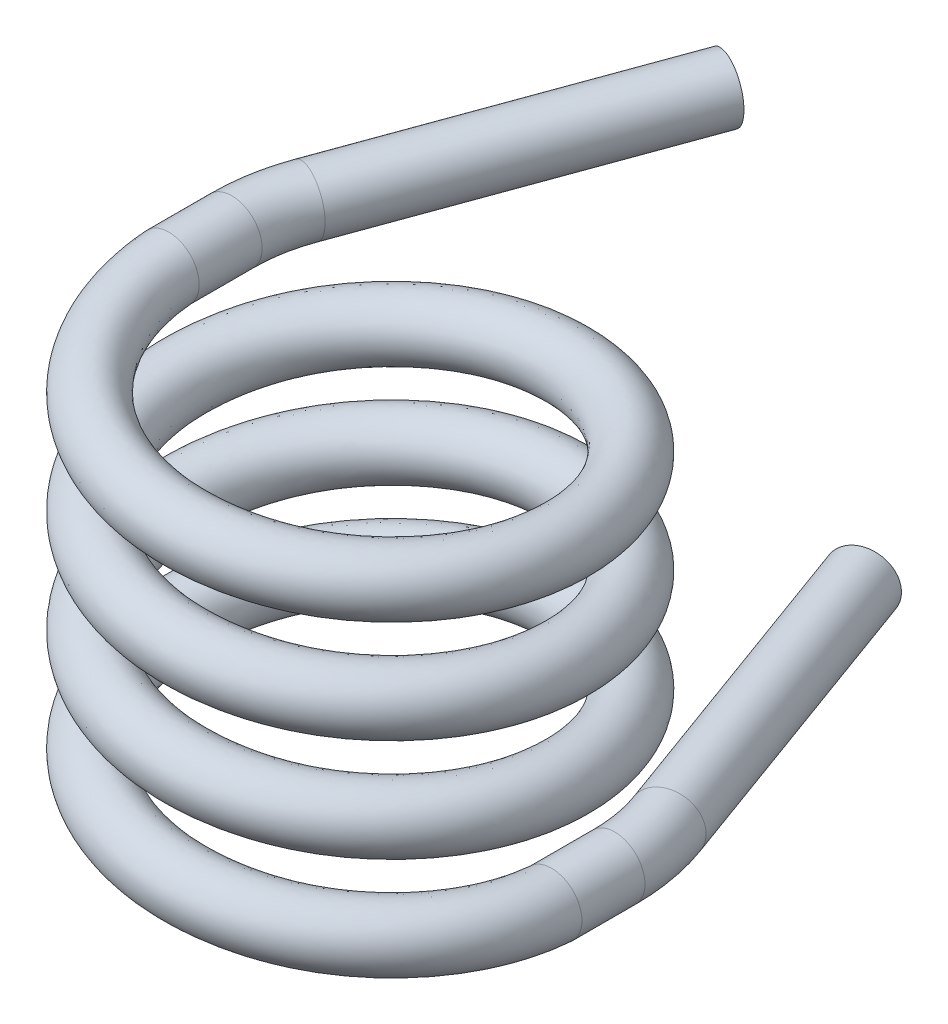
ISO-10303-21;
HEADER;
FILE_DESCRIPTION(('STEP AP214'),'2;1');
FILE_NAME('part.step','',(''),(''),'','','');
FILE_SCHEMA(('AUTOMOTIVE_DESIGN { 1 0 10303 214 1 1 1 1 }'));
ENDSEC;
DATA;
#1=APPLICATION_CONTEXT('core data for automotive mechanical design processes');
#2=APPLICATION_PROTOCOL_DEFINITION('international standard','automotive_design',2000,#1);
#3=PRODUCT_CONTEXT('',#1,'mechanical');
#4=PRODUCT('Part','Part','',(#3));
#5=PRODUCT_RELATED_PRODUCT_CATEGORY('part','',(#4));
#6=PRODUCT_DEFINITION_FORMATION('','',#4);
#7=PRODUCT_DEFINITION_CONTEXT('part definition',#1,'design');
#8=PRODUCT_DEFINITION('design','',#6,#7);
#9=PRODUCT_DEFINITION_SHAPE('','',#8);
#10=(LENGTH_UNIT() NAMED_UNIT(*) SI_UNIT(.MILLI.,.METRE.));
#11=(NAMED_UNIT(*) PLANE_ANGLE_UNIT() SI_UNIT($,.RADIAN.));
#12=(NAMED_UNIT(*) SI_UNIT($,.STERADIAN.) SOLID_ANGLE_UNIT());
#13=UNCERTAINTY_MEASURE_WITH_UNIT(LENGTH_MEASURE(1.E-05),#10,'distance_accuracy_value','');
#14=(GEOMETRIC_REPRESENTATION_CONTEXT(3) GLOBAL_UNCERTAINTY_ASSIGNED_CONTEXT((#13)) GLOBAL_UNIT_ASSIGNED_CONTEXT((#10,
#11,#12)) REPRESENTATION_CONTEXT('',''));
#15=CARTESIAN_POINT('',(0.,0.,0.));
#16=DIRECTION('',(0.,0.,1.));
#17=DIRECTION('',(1.,0.,0.));
#18=AXIS2_PLACEMENT_3D('',#15,#16,#17);
#19=CARTESIAN_POINT('',(23.7499999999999,-38.5,-1.88265629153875E-13));
#20=CARTESIAN_POINT('',(23.75,-37.8125,9.8375721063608));
#21=CARTESIAN_POINT('',(16.7937860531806,-37.125,16.7937860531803));
#22=CARTESIAN_POINT('',(9.83757210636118,-36.4375,23.7499999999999));
#23=CARTESIAN_POINT('',(1.89719897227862E-13,-35.75,23.7499999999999));
#24=CARTESIAN_POINT('',(-9.83757210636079,-35.0625,23.75));
#25=CARTESIAN_POINT('',(-16.7937860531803,-34.375,16.7937860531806));
#26=CARTESIAN_POINT('',(-23.7499999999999,-33.6875,9.83757210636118));
#27=CARTESIAN_POINT('',(-23.7499999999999,-33.,1.9117416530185E-13));
#28=CARTESIAN_POINT('',(-23.75,-32.3125,-9.83757210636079));
#29=CARTESIAN_POINT('',(-16.7937860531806,-31.625,-16.7937860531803));
#30=CARTESIAN_POINT('',(-9.83757210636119,-30.9375,-23.7499999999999));
#31=CARTESIAN_POINT('',(-1.92628433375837E-13,-30.25,-23.7499999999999));
#32=CARTESIAN_POINT('',(9.8375721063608,-29.5625,-23.75));
#33=CARTESIAN_POINT('',(16.7937860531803,-28.875,-16.7937860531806));
#34=CARTESIAN_POINT('',(23.7499999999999,-28.1875,-9.83757210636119));
#35=CARTESIAN_POINT('',(23.7499999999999,-27.5,-1.88265629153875E-13));
#36=CARTESIAN_POINT('',(23.75,-26.8125,9.8375721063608));
#37=CARTESIAN_POINT('',(16.7937860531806,-26.125,16.7937860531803));
#38=CARTESIAN_POINT('',(9.83757210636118,-25.4375,23.7499999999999));
#39=CARTESIAN_POINT('',(1.89719897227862E-13,-24.75,23.7499999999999));
#40=CARTESIAN_POINT('',(-9.83757210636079,-24.0625,23.75));
#41=CARTESIAN_POINT('',(-16.7937860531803,-23.375,16.7937860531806));
#42=CARTESIAN_POINT('',(-23.7499999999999,-22.6875,9.83757210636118));
#43=CARTESIAN_POINT('',(-23.7499999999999,-22.,1.9117416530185E-13));
#44=CARTESIAN_POINT('',(-23.75,-21.3125,-9.83757210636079));
#45=CARTESIAN_POINT('',(-16.7937860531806,-20.625,-16.7937860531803));
#46=CARTESIAN_POINT('',(-9.83757210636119,-19.9375,-23.7499999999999));
#47=CARTESIAN_POINT('',(-1.92628433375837E-13,-19.25,-23.7499999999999));
#48=CARTESIAN_POINT('',(9.8375721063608,-18.5625,-23.75));
#49=CARTESIAN_POINT('',(16.7937860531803,-17.875,-16.7937860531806));
#50=CARTESIAN_POINT('',(23.7499999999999,-17.1875,-9.83757210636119));
#51=CARTESIAN_POINT('',(23.7499999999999,-16.5,-1.88265629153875E-13));
#52=CARTESIAN_POINT('',(23.75,-15.8125,9.8375721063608));
#53=CARTESIAN_POINT('',(16.7937860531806,-15.125,16.7937860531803));
#54=CARTESIAN_POINT('',(9.83757210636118,-14.4375,23.7499999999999));
#55=CARTESIAN_POINT('',(1.89719897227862E-13,-13.75,23.7499999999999));
#56=CARTESIAN_POINT('',(-9.83757210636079,-13.0625,23.75));
#57=CARTESIAN_POINT('',(-16.7937860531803,-12.375,16.7937860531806));
#58=CARTESIAN_POINT('',(-23.7499999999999,-11.6875,9.83757210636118));
#59=CARTESIAN_POINT('',(-23.7499999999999,-11.,1.9117416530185E-13));
#60=CARTESIAN_POINT('',(-23.75,-10.3125000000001,-9.83757210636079));
#61=CARTESIAN_POINT('',(-16.7937860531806,-9.62500000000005,-16.7937860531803));
#62=CARTESIAN_POINT('',(-9.83757210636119,-8.93750000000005,-23.7499999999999));
#63=CARTESIAN_POINT('',(-1.92628433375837E-13,-8.25000000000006,-23.7499999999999));
#64=CARTESIAN_POINT('',(9.8375721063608,-7.56250000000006,-23.75));
#65=CARTESIAN_POINT('',(16.7937860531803,-6.87500000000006,-16.7937860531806));
#66=CARTESIAN_POINT('',(23.7499999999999,-6.18750000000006,-9.83757210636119));
#67=CARTESIAN_POINT('',(23.7499999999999,-5.50000000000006,-1.88265629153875E-13));
#68=CARTESIAN_POINT('',(23.75,-4.81250000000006,9.8375721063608));
#69=CARTESIAN_POINT('',(16.7937860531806,-4.12500000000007,16.7937860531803));
#70=CARTESIAN_POINT('',(9.83757210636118,-3.43750000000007,23.7499999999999));
#71=CARTESIAN_POINT('',(1.89719897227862E-13,-2.75000000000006,23.7499999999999));
#72=CARTESIAN_POINT('',(-9.83757210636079,-2.06250000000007,23.75));
#73=CARTESIAN_POINT('',(-16.7937860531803,-1.37500000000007,16.7937860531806));
#74=CARTESIAN_POINT('',(-23.7499999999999,-0.68750000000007,9.83757210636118));
#75=CARTESIAN_POINT('',(-23.7499999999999,0.,1.9117416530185E-13));
#76=CARTESIAN_POINT('',(-23.75,0.687499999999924,-9.83757210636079));
#77=CARTESIAN_POINT('',(-16.7937860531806,1.37499999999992,-16.7937860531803));
#78=CARTESIAN_POINT('',(-9.83757210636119,2.06249999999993,-23.7499999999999));
#79=CARTESIAN_POINT('',(-1.92628433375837E-13,2.74999999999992,-23.7499999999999));
#80=CARTESIAN_POINT('',(9.8375721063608,3.43749999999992,-23.75));
#81=CARTESIAN_POINT('',(16.7937860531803,4.12499999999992,-16.7937860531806));
#82=CARTESIAN_POINT('',(23.7499999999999,4.81249999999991,-9.83757210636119));
#83=CARTESIAN_POINT('',(23.7499999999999,5.49999999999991,-1.88265629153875E-13));
#84=CARTESIAN_POINT('',(23.7499999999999,-32.,-1.88265629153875E-13));
#85=CARTESIAN_POINT('',(23.75,-31.3125,9.8375721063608));
#86=CARTESIAN_POINT('',(16.7937860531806,-30.625,16.7937860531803));
#87=CARTESIAN_POINT('',(9.83757210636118,-29.9375,23.7499999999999));
#88=CARTESIAN_POINT('',(1.89719897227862E-13,-29.25,23.7499999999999));
#89=CARTESIAN_POINT('',(-9.83757210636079,-28.5625,23.75));
#90=CARTESIAN_POINT('',(-16.7937860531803,-27.875,16.7937860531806));
#91=CARTESIAN_POINT('',(-23.7499999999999,-27.1875,9.83757210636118));
#92=CARTESIAN_POINT('',(-23.7499999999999,-26.5,1.9117416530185E-13));
#93=CARTESIAN_POINT('',(-23.75,-25.8125,-9.83757210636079));
#94=CARTESIAN_POINT('',(-16.7937860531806,-25.125,-16.7937860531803));
#95=CARTESIAN_POINT('',(-9.83757210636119,-24.4375,-23.7499999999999));
#96=CARTESIAN_POINT('',(-1.92628433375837E-13,-23.75,-23.7499999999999));
#97=CARTESIAN_POINT('',(9.8375721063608,-23.0625,-23.75));
#98=CARTESIAN_POINT('',(16.7937860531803,-22.375,-16.7937860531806));
#99=CARTESIAN_POINT('',(23.7499999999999,-21.6875,-9.83757210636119));
#100=CARTESIAN_POINT('',(23.7499999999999,-21.,-1.88265629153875E-13));
#101=CARTESIAN_POINT('',(23.75,-20.3125,9.8375721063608));
#102=CARTESIAN_POINT('',(16.7937860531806,-19.625,16.7937860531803));
#103=CARTESIAN_POINT('',(9.83757210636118,-18.9375,23.7499999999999));
#104=CARTESIAN_POINT('',(1.89719897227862E-13,-18.25,23.7499999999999));
#105=CARTESIAN_POINT('',(-9.83757210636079,-17.5625,23.75));
#106=CARTESIAN_POINT('',(-16.7937860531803,-16.875,16.7937860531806));
#107=CARTESIAN_POINT('',(-23.7499999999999,-16.1875,9.83757210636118));
#108=CARTESIAN_POINT('',(-23.7499999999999,-15.5,1.9117416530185E-13));
#109=CARTESIAN_POINT('',(-23.75,-14.8125,-9.83757210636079));
#110=CARTESIAN_POINT('',(-16.7937860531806,-14.125,-16.7937860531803));
#111=CARTESIAN_POINT('',(-9.83757210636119,-13.4375,-23.7499999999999));
#112=CARTESIAN_POINT('',(-1.92628433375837E-13,-12.75,-23.7499999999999));
#113=CARTESIAN_POINT('',(9.8375721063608,-12.0625,-23.75));
#114=CARTESIAN_POINT('',(16.7937860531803,-11.375,-16.7937860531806));
#115=CARTESIAN_POINT('',(23.7499999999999,-10.6875,-9.83757210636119));
#116=CARTESIAN_POINT('',(23.7499999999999,-10.,-1.88265629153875E-13));
#117=CARTESIAN_POINT('',(23.75,-9.31250000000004,9.8375721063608));
#118=CARTESIAN_POINT('',(16.7937860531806,-8.62500000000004,16.7937860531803));
#119=CARTESIAN_POINT('',(9.83757210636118,-7.93750000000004,23.7499999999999));
#120=CARTESIAN_POINT('',(1.89719897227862E-13,-7.25000000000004,23.7499999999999));
#121=CARTESIAN_POINT('',(-9.83757210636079,-6.56250000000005,23.75));
#122=CARTESIAN_POINT('',(-16.7937860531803,-5.87500000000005,16.7937860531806));
#123=CARTESIAN_POINT('',(-23.7499999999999,-5.18750000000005,9.83757210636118));
#124=CARTESIAN_POINT('',(-23.7499999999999,-4.50000000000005,1.9117416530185E-13));
#125=CARTESIAN_POINT('',(-23.75,-3.81250000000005,-9.83757210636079));
#126=CARTESIAN_POINT('',(-16.7937860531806,-3.12500000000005,-16.7937860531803));
#127=CARTESIAN_POINT('',(-9.83757210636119,-2.43750000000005,-23.7499999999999));
#128=CARTESIAN_POINT('',(-1.92628433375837E-13,-1.75000000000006,-23.7499999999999));
#129=CARTESIAN_POINT('',(9.8375721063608,-1.06250000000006,-23.75));
#130=CARTESIAN_POINT('',(16.7937860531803,-0.375000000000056,-16.7937860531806));
#131=CARTESIAN_POINT('',(23.7499999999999,0.312499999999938,-9.83757210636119));
#132=CARTESIAN_POINT('',(23.7499999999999,0.999999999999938,-1.88265629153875E-13));
#133=CARTESIAN_POINT('',(23.75,1.68749999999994,9.8375721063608));
#134=CARTESIAN_POINT('',(16.7937860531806,2.37499999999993,16.7937860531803));
#135=CARTESIAN_POINT('',(9.83757210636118,3.06249999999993,23.7499999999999));
#136=CARTESIAN_POINT('',(1.89719897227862E-13,3.74999999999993,23.7499999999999));
#137=CARTESIAN_POINT('',(-9.83757210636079,4.43749999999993,23.75));
#138=CARTESIAN_POINT('',(-16.7937860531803,5.12499999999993,16.7937860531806));
#139=CARTESIAN_POINT('',(-23.7499999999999,5.81249999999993,9.83757210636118));
#140=CARTESIAN_POINT('',(-23.7499999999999,6.49999999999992,1.9117416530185E-13));
#141=CARTESIAN_POINT('',(-23.75,7.18749999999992,-9.83757210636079));
#142=CARTESIAN_POINT('',(-16.7937860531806,7.87499999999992,-16.7937860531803));
#143=CARTESIAN_POINT('',(-9.83757210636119,8.56249999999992,-23.7499999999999));
#144=CARTESIAN_POINT('',(-1.92628433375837E-13,9.24999999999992,-23.7499999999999));
#145=CARTESIAN_POINT('',(9.8375721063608,9.93749999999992,-23.75));
#146=CARTESIAN_POINT('',(16.7937860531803,10.6249999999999,-16.7937860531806));
#147=CARTESIAN_POINT('',(23.7499999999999,11.3124999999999,-9.83757210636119));
#148=CARTESIAN_POINT('',(23.7499999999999,11.9999999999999,-1.88265629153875E-13));
#149=CARTESIAN_POINT('',(17.2499999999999,-32.,-1.36740299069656E-13));
#150=CARTESIAN_POINT('',(17.25,-31.3125,7.14518395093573));
#151=CARTESIAN_POINT('',(12.197591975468,-30.625,12.1975919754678));
#152=CARTESIAN_POINT('',(7.145183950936,-29.9375,17.2499999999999));
#153=CARTESIAN_POINT('',(1.37796556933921E-13,-29.25,17.2499999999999));
#154=CARTESIAN_POINT('',(-7.14518395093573,-28.5625,17.25));
#155=CARTESIAN_POINT('',(-12.1975919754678,-27.875,12.197591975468));
#156=CARTESIAN_POINT('',(-17.2499999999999,-27.1875,7.145183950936));
#157=CARTESIAN_POINT('',(-17.2499999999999,-26.5,1.38852814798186E-13));
#158=CARTESIAN_POINT('',(-17.25,-25.8125,-7.14518395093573));
#159=CARTESIAN_POINT('',(-12.197591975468,-25.125,-12.1975919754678));
#160=CARTESIAN_POINT('',(-7.14518395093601,-24.4375,-17.2499999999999));
#161=CARTESIAN_POINT('',(-1.3990907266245E-13,-23.75,-17.2499999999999));
#162=CARTESIAN_POINT('',(7.14518395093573,-23.0625,-17.25));
#163=CARTESIAN_POINT('',(12.1975919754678,-22.375,-12.197591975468));
#164=CARTESIAN_POINT('',(17.2499999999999,-21.6875,-7.14518395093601));
#165=CARTESIAN_POINT('',(17.2499999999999,-21.,-1.36740299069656E-13));
#166=CARTESIAN_POINT('',(17.25,-20.3125,7.14518395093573));
#167=CARTESIAN_POINT('',(12.197591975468,-19.625,12.1975919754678));
#168=CARTESIAN_POINT('',(7.145183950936,-18.9375,17.2499999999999));
#169=CARTESIAN_POINT('',(1.37796556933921E-13,-18.25,17.2499999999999));
#170=CARTESIAN_POINT('',(-7.14518395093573,-17.5625,17.25));
#171=CARTESIAN_POINT('',(-12.1975919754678,-16.875,12.197591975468));
#172=CARTESIAN_POINT('',(-17.2499999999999,-16.1875,7.145183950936));
#173=CARTESIAN_POINT('',(-17.2499999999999,-15.5,1.38852814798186E-13));
#174=CARTESIAN_POINT('',(-17.25,-14.8125,-7.14518395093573));
#175=CARTESIAN_POINT('',(-12.197591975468,-14.125,-12.1975919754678));
#176=CARTESIAN_POINT('',(-7.14518395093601,-13.4375,-17.2499999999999));
#177=CARTESIAN_POINT('',(-1.3990907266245E-13,-12.75,-17.2499999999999));
#178=CARTESIAN_POINT('',(7.14518395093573,-12.0625,-17.25));
#179=CARTESIAN_POINT('',(12.1975919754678,-11.375,-12.197591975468));
#180=CARTESIAN_POINT('',(17.2499999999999,-10.6875,-7.14518395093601));
#181=CARTESIAN_POINT('',(17.2499999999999,-10.,-1.36740299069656E-13));
#182=CARTESIAN_POINT('',(17.25,-9.31250000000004,7.14518395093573));
#183=CARTESIAN_POINT('',(12.197591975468,-8.62500000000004,12.1975919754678));
#184=CARTESIAN_POINT('',(7.145183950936,-7.93750000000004,17.2499999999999));
#185=CARTESIAN_POINT('',(1.37796556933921E-13,-7.25000000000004,17.2499999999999));
#186=CARTESIAN_POINT('',(-7.14518395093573,-6.56250000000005,17.25));
#187=CARTESIAN_POINT('',(-12.1975919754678,-5.87500000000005,12.197591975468));
#188=CARTESIAN_POINT('',(-17.2499999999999,-5.18750000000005,7.145183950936));
#189=CARTESIAN_POINT('',(-17.2499999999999,-4.50000000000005,1.38852814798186E-13));
#190=CARTESIAN_POINT('',(-17.25,-3.81250000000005,-7.14518395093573));
#191=CARTESIAN_POINT('',(-12.197591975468,-3.12500000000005,-12.1975919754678));
#192=CARTESIAN_POINT('',(-7.14518395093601,-2.43750000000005,-17.2499999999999));
#193=CARTESIAN_POINT('',(-1.3990907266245E-13,-1.75000000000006,-17.2499999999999));
#194=CARTESIAN_POINT('',(7.14518395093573,-1.06250000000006,-17.25));
#195=CARTESIAN_POINT('',(12.1975919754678,-0.375000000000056,-12.197591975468));
#196=CARTESIAN_POINT('',(17.2499999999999,0.312499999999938,-7.14518395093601));
#197=CARTESIAN_POINT('',(17.2499999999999,0.999999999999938,-1.36740299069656E-13));
#198=CARTESIAN_POINT('',(17.25,1.68749999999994,7.14518395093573));
#199=CARTESIAN_POINT('',(12.197591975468,2.37499999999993,12.1975919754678));
#200=CARTESIAN_POINT('',(7.145183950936,3.06249999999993,17.2499999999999));
#201=CARTESIAN_POINT('',(1.37796556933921E-13,3.74999999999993,17.2499999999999));
#202=CARTESIAN_POINT('',(-7.14518395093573,4.43749999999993,17.25));
#203=CARTESIAN_POINT('',(-12.1975919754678,5.12499999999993,12.197591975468));
#204=CARTESIAN_POINT('',(-17.2499999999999,5.81249999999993,7.145183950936));
#205=CARTESIAN_POINT('',(-17.2499999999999,6.49999999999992,1.38852814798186E-13));
#206=CARTESIAN_POINT('',(-17.25,7.18749999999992,-7.14518395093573));
#207=CARTESIAN_POINT('',(-12.197591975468,7.87499999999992,-12.1975919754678));
#208=CARTESIAN_POINT('',(-7.14518395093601,8.56249999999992,-17.2499999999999));
#209=CARTESIAN_POINT('',(-1.3990907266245E-13,9.24999999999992,-17.2499999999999));
#210=CARTESIAN_POINT('',(7.14518395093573,9.93749999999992,-17.25));
#211=CARTESIAN_POINT('',(12.1975919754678,10.6249999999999,-12.197591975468));
#212=CARTESIAN_POINT('',(17.2499999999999,11.3124999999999,-7.14518395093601));
#213=CARTESIAN_POINT('',(17.2499999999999,11.9999999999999,-1.36740299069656E-13));
#214=CARTESIAN_POINT('',(17.2499999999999,-38.5,-1.36740299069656E-13));
#215=CARTESIAN_POINT('',(17.25,-37.8125,7.14518395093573));
#216=CARTESIAN_POINT('',(12.197591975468,-37.125,12.1975919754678));
#217=CARTESIAN_POINT('',(7.145183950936,-36.4375,17.2499999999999));
#218=CARTESIAN_POINT('',(1.37796556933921E-13,-35.75,17.2499999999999));
#219=CARTESIAN_POINT('',(-7.14518395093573,-35.0625,17.25));
#220=CARTESIAN_POINT('',(-12.1975919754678,-34.375,12.197591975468));
#221=CARTESIAN_POINT('',(-17.2499999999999,-33.6875,7.145183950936));
#222=CARTESIAN_POINT('',(-17.2499999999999,-33.,1.38852814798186E-13));
#223=CARTESIAN_POINT('',(-17.25,-32.3125,-7.14518395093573));
#224=CARTESIAN_POINT('',(-12.197591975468,-31.625,-12.1975919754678));
#225=CARTESIAN_POINT('',(-7.14518395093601,-30.9375,-17.2499999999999));
#226=CARTESIAN_POINT('',(-1.3990907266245E-13,-30.25,-17.2499999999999));
#227=CARTESIAN_POINT('',(7.14518395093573,-29.5625,-17.25));
#228=CARTESIAN_POINT('',(12.1975919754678,-28.875,-12.197591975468));
#229=CARTESIAN_POINT('',(17.2499999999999,-28.1875,-7.14518395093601));
#230=CARTESIAN_POINT('',(17.2499999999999,-27.5,-1.36740299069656E-13));
#231=CARTESIAN_POINT('',(17.25,-26.8125,7.14518395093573));
#232=CARTESIAN_POINT('',(12.197591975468,-26.125,12.1975919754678));
#233=CARTESIAN_POINT('',(7.145183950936,-25.4375,17.2499999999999));
#234=CARTESIAN_POINT('',(1.37796556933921E-13,-24.75,17.2499999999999));
#235=CARTESIAN_POINT('',(-7.14518395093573,-24.0625,17.25));
#236=CARTESIAN_POINT('',(-12.1975919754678,-23.375,12.197591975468));
#237=CARTESIAN_POINT('',(-17.2499999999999,-22.6875,7.145183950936));
#238=CARTESIAN_POINT('',(-17.2499999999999,-22.,1.38852814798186E-13));
#239=CARTESIAN_POINT('',(-17.25,-21.3125,-7.14518395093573));
#240=CARTESIAN_POINT('',(-12.197591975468,-20.625,-12.1975919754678));
#241=CARTESIAN_POINT('',(-7.14518395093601,-19.9375,-17.2499999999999));
#242=CARTESIAN_POINT('',(-1.3990907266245E-13,-19.25,-17.2499999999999));
#243=CARTESIAN_POINT('',(7.14518395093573,-18.5625,-17.25));
#244=CARTESIAN_POINT('',(12.1975919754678,-17.875,-12.197591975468));
#245=CARTESIAN_POINT('',(17.2499999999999,-17.1875,-7.14518395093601));
#246=CARTESIAN_POINT('',(17.2499999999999,-16.5,-1.36740299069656E-13));
#247=CARTESIAN_POINT('',(17.25,-15.8125,7.14518395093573));
#248=CARTESIAN_POINT('',(12.197591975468,-15.125,12.1975919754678));
#249=CARTESIAN_POINT('',(7.145183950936,-14.4375,17.2499999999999));
#250=CARTESIAN_POINT('',(1.37796556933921E-13,-13.75,17.2499999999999));
#251=CARTESIAN_POINT('',(-7.14518395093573,-13.0625,17.25));
#252=CARTESIAN_POINT('',(-12.1975919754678,-12.375,12.197591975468));
#253=CARTESIAN_POINT('',(-17.2499999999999,-11.6875,7.145183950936));
#254=CARTESIAN_POINT('',(-17.2499999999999,-11.,1.38852814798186E-13));
#255=CARTESIAN_POINT('',(-17.25,-10.3125000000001,-7.14518395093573));
#256=CARTESIAN_POINT('',(-12.197591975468,-9.62500000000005,-12.1975919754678));
#257=CARTESIAN_POINT('',(-7.14518395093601,-8.93750000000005,-17.2499999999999));
#258=CARTESIAN_POINT('',(-1.3990907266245E-13,-8.25000000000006,-17.2499999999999));
#259=CARTESIAN_POINT('',(7.14518395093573,-7.56250000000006,-17.25));
#260=CARTESIAN_POINT('',(12.1975919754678,-6.87500000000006,-12.197591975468));
#261=CARTESIAN_POINT('',(17.2499999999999,-6.18750000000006,-7.14518395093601));
#262=CARTESIAN_POINT('',(17.2499999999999,-5.50000000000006,-1.36740299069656E-13));
#263=CARTESIAN_POINT('',(17.25,-4.81250000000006,7.14518395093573));
#264=CARTESIAN_POINT('',(12.197591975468,-4.12500000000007,12.1975919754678));
#265=CARTESIAN_POINT('',(7.145183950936,-3.43750000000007,17.2499999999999));
#266=CARTESIAN_POINT('',(1.37796556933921E-13,-2.75000000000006,17.2499999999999));
#267=CARTESIAN_POINT('',(-7.14518395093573,-2.06250000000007,17.25));
#268=CARTESIAN_POINT('',(-12.1975919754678,-1.37500000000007,12.197591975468));
#269=CARTESIAN_POINT('',(-17.2499999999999,-0.68750000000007,7.145183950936));
#270=CARTESIAN_POINT('',(-17.2499999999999,0.,1.38852814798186E-13));
#271=CARTESIAN_POINT('',(-17.25,0.687499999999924,-7.14518395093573));
#272=CARTESIAN_POINT('',(-12.197591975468,1.37499999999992,-12.1975919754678));
#273=CARTESIAN_POINT('',(-7.14518395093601,2.06249999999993,-17.2499999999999));
#274=CARTESIAN_POINT('',(-1.3990907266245E-13,2.74999999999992,-17.2499999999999));
#275=CARTESIAN_POINT('',(7.14518395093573,3.43749999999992,-17.25));
#276=CARTESIAN_POINT('',(12.1975919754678,4.12499999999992,-12.197591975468));
#277=CARTESIAN_POINT('',(17.2499999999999,4.81249999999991,-7.14518395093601));
#278=CARTESIAN_POINT('',(17.2499999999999,5.49999999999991,-1.36740299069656E-13));
#279=CARTESIAN_POINT('',(17.2499999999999,-45.,-1.36740299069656E-13));
#280=CARTESIAN_POINT('',(17.25,-44.3125,7.14518395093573));
#281=CARTESIAN_POINT('',(12.197591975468,-43.625,12.1975919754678));
#282=CARTESIAN_POINT('',(7.145183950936,-42.9375,17.2499999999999));
#283=CARTESIAN_POINT('',(1.37796556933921E-13,-42.25,17.2499999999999));
#284=CARTESIAN_POINT('',(-7.14518395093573,-41.5625,17.25));
#285=CARTESIAN_POINT('',(-12.1975919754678,-40.875,12.197591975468));
#286=CARTESIAN_POINT('',(-17.2499999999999,-40.1875,7.145183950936));
#287=CARTESIAN_POINT('',(-17.2499999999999,-39.5,1.38852814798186E-13));
#288=CARTESIAN_POINT('',(-17.25,-38.8125,-7.14518395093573));
#289=CARTESIAN_POINT('',(-12.197591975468,-38.125,-12.1975919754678));
#290=CARTESIAN_POINT('',(-7.14518395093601,-37.4375,-17.2499999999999));
#291=CARTESIAN_POINT('',(-1.3990907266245E-13,-36.75,-17.2499999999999));
#292=CARTESIAN_POINT('',(7.14518395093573,-36.0625,-17.25));
#293=CARTESIAN_POINT('',(12.1975919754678,-35.375,-12.197591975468));
#294=CARTESIAN_POINT('',(17.2499999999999,-34.6875,-7.14518395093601));
#295=CARTESIAN_POINT('',(17.2499999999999,-34.,-1.36740299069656E-13));
#296=CARTESIAN_POINT('',(17.25,-33.3125,7.14518395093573));
#297=CARTESIAN_POINT('',(12.197591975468,-32.625,12.1975919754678));
#298=CARTESIAN_POINT('',(7.145183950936,-31.9375,17.2499999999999));
#299=CARTESIAN_POINT('',(1.37796556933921E-13,-31.25,17.2499999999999));
#300=CARTESIAN_POINT('',(-7.14518395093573,-30.5625,17.25));
#301=CARTESIAN_POINT('',(-12.1975919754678,-29.875,12.197591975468));
#302=CARTESIAN_POINT('',(-17.2499999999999,-29.1875,7.145183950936));
#303=CARTESIAN_POINT('',(-17.2499999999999,-28.5,1.38852814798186E-13));
#304=CARTESIAN_POINT('',(-17.25,-27.8125,-7.14518395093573));
#305=CARTESIAN_POINT('',(-12.197591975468,-27.125,-12.1975919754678));
#306=CARTESIAN_POINT('',(-7.14518395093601,-26.4375,-17.2499999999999));
#307=CARTESIAN_POINT('',(-1.3990907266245E-13,-25.75,-17.2499999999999));
#308=CARTESIAN_POINT('',(7.14518395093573,-25.0625,-17.25));
#309=CARTESIAN_POINT('',(12.1975919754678,-24.375,-12.197591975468));
#310=CARTESIAN_POINT('',(17.2499999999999,-23.6875,-7.14518395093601));
#311=CARTESIAN_POINT('',(17.2499999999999,-23.,-1.36740299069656E-13));
#312=CARTESIAN_POINT('',(17.25,-22.3125,7.14518395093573));
#313=CARTESIAN_POINT('',(12.197591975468,-21.625,12.1975919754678));
#314=CARTESIAN_POINT('',(7.145183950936,-20.9375,17.2499999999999));
#315=CARTESIAN_POINT('',(1.37796556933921E-13,-20.25,17.2499999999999));
#316=CARTESIAN_POINT('',(-7.14518395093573,-19.5625,17.25));
#317=CARTESIAN_POINT('',(-12.1975919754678,-18.875,12.197591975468));
#318=CARTESIAN_POINT('',(-17.2499999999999,-18.1875,7.145183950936));
#319=CARTESIAN_POINT('',(-17.2499999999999,-17.5,1.38852814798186E-13));
#320=CARTESIAN_POINT('',(-17.25,-16.8125,-7.14518395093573));
#321=CARTESIAN_POINT('',(-12.197591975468,-16.125,-12.1975919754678));
#322=CARTESIAN_POINT('',(-7.14518395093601,-15.4375000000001,-17.2499999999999));
#323=CARTESIAN_POINT('',(-1.3990907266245E-13,-14.7500000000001,-17.2499999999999));
#324=CARTESIAN_POINT('',(7.14518395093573,-14.0625000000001,-17.25));
#325=CARTESIAN_POINT('',(12.1975919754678,-13.3750000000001,-12.197591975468));
#326=CARTESIAN_POINT('',(17.2499999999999,-12.6875000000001,-7.14518395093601));
#327=CARTESIAN_POINT('',(17.2499999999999,-12.0000000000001,-1.36740299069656E-13));
#328=CARTESIAN_POINT('',(17.25,-11.3125000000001,7.14518395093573));
#329=CARTESIAN_POINT('',(12.197591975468,-10.6250000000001,12.1975919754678));
#330=CARTESIAN_POINT('',(7.145183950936,-9.93750000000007,17.2499999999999));
#331=CARTESIAN_POINT('',(1.37796556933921E-13,-9.25000000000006,17.2499999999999));
#332=CARTESIAN_POINT('',(-7.14518395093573,-8.56250000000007,17.25));
#333=CARTESIAN_POINT('',(-12.1975919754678,-7.87500000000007,12.197591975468));
#334=CARTESIAN_POINT('',(-17.2499999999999,-7.18750000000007,7.145183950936));
#335=CARTESIAN_POINT('',(-17.2499999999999,-6.50000000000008,1.38852814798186E-13));
#336=CARTESIAN_POINT('',(-17.25,-5.81250000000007,-7.14518395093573));
#337=CARTESIAN_POINT('',(-12.197591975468,-5.12500000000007,-12.1975919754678));
#338=CARTESIAN_POINT('',(-7.14518395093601,-4.43750000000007,-17.2499999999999));
#339=CARTESIAN_POINT('',(-1.3990907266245E-13,-3.75000000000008,-17.2499999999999));
#340=CARTESIAN_POINT('',(7.14518395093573,-3.06250000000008,-17.25));
#341=CARTESIAN_POINT('',(12.1975919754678,-2.37500000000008,-12.197591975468));
#342=CARTESIAN_POINT('',(17.2499999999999,-1.68750000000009,-7.14518395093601));
#343=CARTESIAN_POINT('',(17.2499999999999,-1.00000000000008,-1.36740299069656E-13));
#344=CARTESIAN_POINT('',(23.7499999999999,-45.,-1.88265629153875E-13));
#345=CARTESIAN_POINT('',(23.75,-44.3125,9.8375721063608));
#346=CARTESIAN_POINT('',(16.7937860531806,-43.625,16.7937860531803));
#347=CARTESIAN_POINT('',(9.83757210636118,-42.9375,23.7499999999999));
#348=CARTESIAN_POINT('',(1.89719897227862E-13,-42.25,23.7499999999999));
#349=CARTESIAN_POINT('',(-9.83757210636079,-41.5625,23.75));
#350=CARTESIAN_POINT('',(-16.7937860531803,-40.875,16.7937860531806));
#351=CARTESIAN_POINT('',(-23.7499999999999,-40.1875,9.83757210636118));
#352=CARTESIAN_POINT('',(-23.7499999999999,-39.5,1.9117416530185E-13));
#353=CARTESIAN_POINT('',(-23.75,-38.8125,-9.83757210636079));
#354=CARTESIAN_POINT('',(-16.7937860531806,-38.125,-16.7937860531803));
#355=CARTESIAN_POINT('',(-9.83757210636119,-37.4375,-23.7499999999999));
#356=CARTESIAN_POINT('',(-1.92628433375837E-13,-36.75,-23.7499999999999));
#357=CARTESIAN_POINT('',(9.8375721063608,-36.0625,-23.75));
#358=CARTESIAN_POINT('',(16.7937860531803,-35.375,-16.7937860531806));
#359=CARTESIAN_POINT('',(23.7499999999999,-34.6875,-9.83757210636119));
#360=CARTESIAN_POINT('',(23.7499999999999,-34.,-1.88265629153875E-13));
#361=CARTESIAN_POINT('',(23.75,-33.3125,9.8375721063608));
#362=CARTESIAN_POINT('',(16.7937860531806,-32.625,16.7937860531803));
#363=CARTESIAN_POINT('',(9.83757210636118,-31.9375,23.7499999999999));
#364=CARTESIAN_POINT('',(1.89719897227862E-13,-31.25,23.7499999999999));
#365=CARTESIAN_POINT('',(-9.83757210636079,-30.5625,23.75));
#366=CARTESIAN_POINT('',(-16.7937860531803,-29.875,16.7937860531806));
#367=CARTESIAN_POINT('',(-23.7499999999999,-29.1875,9.83757210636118));
#368=CARTESIAN_POINT('',(-23.7499999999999,-28.5,1.9117416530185E-13));
#369=CARTESIAN_POINT('',(-23.75,-27.8125,-9.83757210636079));
#370=CARTESIAN_POINT('',(-16.7937860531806,-27.125,-16.7937860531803));
#371=CARTESIAN_POINT('',(-9.83757210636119,-26.4375,-23.7499999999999));
#372=CARTESIAN_POINT('',(-1.92628433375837E-13,-25.75,-23.7499999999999));
#373=CARTESIAN_POINT('',(9.8375721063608,-25.0625,-23.75));
#374=CARTESIAN_POINT('',(16.7937860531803,-24.375,-16.7937860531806));
#375=CARTESIAN_POINT('',(23.7499999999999,-23.6875,-9.83757210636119));
#376=CARTESIAN_POINT('',(23.7499999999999,-23.,-1.88265629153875E-13));
#377=CARTESIAN_POINT('',(23.75,-22.3125,9.8375721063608));
#378=CARTESIAN_POINT('',(16.7937860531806,-21.625,16.7937860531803));
#379=CARTESIAN_POINT('',(9.83757210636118,-20.9375,23.7499999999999));
#380=CARTESIAN_POINT('',(1.89719897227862E-13,-20.25,23.7499999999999));
#381=CARTESIAN_POINT('',(-9.83757210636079,-19.5625,23.75));
#382=CARTESIAN_POINT('',(-16.7937860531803,-18.875,16.7937860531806));
#383=CARTESIAN_POINT('',(-23.7499999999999,-18.1875,9.83757210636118));
#384=CARTESIAN_POINT('',(-23.7499999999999,-17.5,1.9117416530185E-13));
#385=CARTESIAN_POINT('',(-23.75,-16.8125,-9.83757210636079));
#386=CARTESIAN_POINT('',(-16.7937860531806,-16.125,-16.7937860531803));
#387=CARTESIAN_POINT('',(-9.83757210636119,-15.4375000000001,-23.7499999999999));
#388=CARTESIAN_POINT('',(-1.92628433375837E-13,-14.7500000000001,-23.7499999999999));
#389=CARTESIAN_POINT('',(9.8375721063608,-14.0625000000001,-23.75));
#390=CARTESIAN_POINT('',(16.7937860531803,-13.3750000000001,-16.7937860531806));
#391=CARTESIAN_POINT('',(23.7499999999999,-12.6875000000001,-9.83757210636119));
#392=CARTESIAN_POINT('',(23.7499999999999,-12.0000000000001,-1.88265629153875E-13));
#393=CARTESIAN_POINT('',(23.75,-11.3125000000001,9.8375721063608));
#394=CARTESIAN_POINT('',(16.7937860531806,-10.6250000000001,16.7937860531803));
#395=CARTESIAN_POINT('',(9.83757210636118,-9.93750000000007,23.7499999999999));
#396=CARTESIAN_POINT('',(1.89719897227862E-13,-9.25000000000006,23.7499999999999));
#397=CARTESIAN_POINT('',(-9.83757210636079,-8.56250000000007,23.75));
#398=CARTESIAN_POINT('',(-16.7937860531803,-7.87500000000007,16.7937860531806));
#399=CARTESIAN_POINT('',(-23.7499999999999,-7.18750000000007,9.83757210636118));
#400=CARTESIAN_POINT('',(-23.7499999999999,-6.50000000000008,1.9117416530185E-13));
#401=CARTESIAN_POINT('',(-23.75,-5.81250000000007,-9.83757210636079));
#402=CARTESIAN_POINT('',(-16.7937860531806,-5.12500000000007,-16.7937860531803));
#403=CARTESIAN_POINT('',(-9.83757210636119,-4.43750000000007,-23.7499999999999));
#404=CARTESIAN_POINT('',(-1.92628433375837E-13,-3.75000000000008,-23.7499999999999));
#405=CARTESIAN_POINT('',(9.8375721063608,-3.06250000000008,-23.75));
#406=CARTESIAN_POINT('',(16.7937860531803,-2.37500000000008,-16.7937860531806));
#407=CARTESIAN_POINT('',(23.7499999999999,-1.68750000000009,-9.83757210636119));
#408=CARTESIAN_POINT('',(23.7499999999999,-1.00000000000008,-1.88265629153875E-13));
#409=CARTESIAN_POINT('',(23.7499999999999,-38.5,-1.88265629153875E-13));
#410=CARTESIAN_POINT('',(23.75,-37.8125,9.8375721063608));
#411=CARTESIAN_POINT('',(16.7937860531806,-37.125,16.7937860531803));
#412=CARTESIAN_POINT('',(9.83757210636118,-36.4375,23.7499999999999));
#413=CARTESIAN_POINT('',(1.89719897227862E-13,-35.75,23.7499999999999));
#414=CARTESIAN_POINT('',(-9.83757210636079,-35.0625,23.75));
#415=CARTESIAN_POINT('',(-16.7937860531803,-34.375,16.7937860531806));
#416=CARTESIAN_POINT('',(-23.7499999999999,-33.6875,9.83757210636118));
#417=CARTESIAN_POINT('',(-23.7499999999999,-33.,1.9117416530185E-13));
#418=CARTESIAN_POINT('',(-23.75,-32.3125,-9.83757210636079));
#419=CARTESIAN_POINT('',(-16.7937860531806,-31.625,-16.7937860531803));
#420=CARTESIAN_POINT('',(-9.83757210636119,-30.9375,-23.7499999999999));
#421=CARTESIAN_POINT('',(-1.92628433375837E-13,-30.25,-23.7499999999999));
#422=CARTESIAN_POINT('',(9.8375721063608,-29.5625,-23.75));
#423=CARTESIAN_POINT('',(16.7937860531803,-28.875,-16.7937860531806));
#424=CARTESIAN_POINT('',(23.7499999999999,-28.1875,-9.83757210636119));
#425=CARTESIAN_POINT('',(23.7499999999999,-27.5,-1.88265629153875E-13));
#426=CARTESIAN_POINT('',(23.75,-26.8125,9.8375721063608));
#427=CARTESIAN_POINT('',(16.7937860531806,-26.125,16.7937860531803));
#428=CARTESIAN_POINT('',(9.83757210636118,-25.4375,23.7499999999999));
#429=CARTESIAN_POINT('',(1.89719897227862E-13,-24.75,23.7499999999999));
#430=CARTESIAN_POINT('',(-9.83757210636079,-24.0625,23.75));
#431=CARTESIAN_POINT('',(-16.7937860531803,-23.375,16.7937860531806));
#432=CARTESIAN_POINT('',(-23.7499999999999,-22.6875,9.83757210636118));
#433=CARTESIAN_POINT('',(-23.7499999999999,-22.,1.9117416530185E-13));
#434=CARTESIAN_POINT('',(-23.75,-21.3125,-9.83757210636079));
#435=CARTESIAN_POINT('',(-16.7937860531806,-20.625,-16.7937860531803));
#436=CARTESIAN_POINT('',(-9.83757210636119,-19.9375,-23.7499999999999));
#437=CARTESIAN_POINT('',(-1.92628433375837E-13,-19.25,-23.7499999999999));
#438=CARTESIAN_POINT('',(9.8375721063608,-18.5625,-23.75));
#439=CARTESIAN_POINT('',(16.7937860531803,-17.875,-16.7937860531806));
#440=CARTESIAN_POINT('',(23.7499999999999,-17.1875,-9.83757210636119));
#441=CARTESIAN_POINT('',(23.7499999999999,-16.5,-1.88265629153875E-13));
#442=CARTESIAN_POINT('',(23.75,-15.8125,9.8375721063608));
#443=CARTESIAN_POINT('',(16.7937860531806,-15.125,16.7937860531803));
#444=CARTESIAN_POINT('',(9.83757210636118,-14.4375,23.7499999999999));
#445=CARTESIAN_POINT('',(1.89719897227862E-13,-13.75,23.7499999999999));
#446=CARTESIAN_POINT('',(-9.83757210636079,-13.0625,23.75));
#447=CARTESIAN_POINT('',(-16.7937860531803,-12.375,16.7937860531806));
#448=CARTESIAN_POINT('',(-23.7499999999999,-11.6875,9.83757210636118));
#449=CARTESIAN_POINT('',(-23.7499999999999,-11.,1.9117416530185E-13));
#450=CARTESIAN_POINT('',(-23.75,-10.3125000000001,-9.83757210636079));
#451=CARTESIAN_POINT('',(-16.7937860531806,-9.62500000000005,-16.7937860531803));
#452=CARTESIAN_POINT('',(-9.83757210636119,-8.93750000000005,-23.7499999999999));
#453=CARTESIAN_POINT('',(-1.92628433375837E-13,-8.25000000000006,-23.7499999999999));
#454=CARTESIAN_POINT('',(9.8375721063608,-7.56250000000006,-23.75));
#455=CARTESIAN_POINT('',(16.7937860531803,-6.87500000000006,-16.7937860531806));
#456=CARTESIAN_POINT('',(23.7499999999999,-6.18750000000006,-9.83757210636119));
#457=CARTESIAN_POINT('',(23.7499999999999,-5.50000000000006,-1.88265629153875E-13));
#458=CARTESIAN_POINT('',(23.75,-4.81250000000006,9.8375721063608));
#459=CARTESIAN_POINT('',(16.7937860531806,-4.12500000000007,16.7937860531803));
#460=CARTESIAN_POINT('',(9.83757210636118,-3.43750000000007,23.7499999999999));
#461=CARTESIAN_POINT('',(1.89719897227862E-13,-2.75000000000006,23.7499999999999));
#462=CARTESIAN_POINT('',(-9.83757210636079,-2.06250000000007,23.75));
#463=CARTESIAN_POINT('',(-16.7937860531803,-1.37500000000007,16.7937860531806));
#464=CARTESIAN_POINT('',(-23.7499999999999,-0.68750000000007,9.83757210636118));
#465=CARTESIAN_POINT('',(-23.7499999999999,0.,1.9117416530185E-13));
#466=CARTESIAN_POINT('',(-23.75,0.687499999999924,-9.83757210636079));
#467=CARTESIAN_POINT('',(-16.7937860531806,1.37499999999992,-16.7937860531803));
#468=CARTESIAN_POINT('',(-9.83757210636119,2.06249999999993,-23.7499999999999));
#469=CARTESIAN_POINT('',(-1.92628433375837E-13,2.74999999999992,-23.7499999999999));
#470=CARTESIAN_POINT('',(9.8375721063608,3.43749999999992,-23.75));
#471=CARTESIAN_POINT('',(16.7937860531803,4.12499999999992,-16.7937860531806));
#472=CARTESIAN_POINT('',(23.7499999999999,4.81249999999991,-9.83757210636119));
#473=CARTESIAN_POINT('',(23.7499999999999,5.49999999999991,-1.88265629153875E-13));
#474=(BOUNDED_SURFACE() B_SPLINE_SURFACE(3,2,((#19,#20,#21,#22,#23,#24,#25,#26,#27,#28,#29,#30,
#31,#32,#33,#34,#35,#36,#37,#38,#39,#40,#41,#42,#43,#44,#45,#46,#47,#48,#49,#50,#51,#52,#53,#54,
#55,#56,#57,#58,#59,#60,#61,#62,#63,#64,#65,#66,#67,#68,#69,#70,#71,#72,#73,#74,#75,#76,#77,#78,
#79,#80,#81,#82,#83),(#84,#85,#86,#87,#88,#89,#90,#91,#92,#93,#94,#95,#96,#97,#98,#99,#100,#101,
#102,#103,#104,#105,#106,#107,#108,#109,#110,#111,#112,#113,#114,#115,#116,#117,#118,#119,#120,
#121,#122,#123,#124,#125,#126,#127,#128,#129,#130,#131,#132,#133,#134,#135,#136,#137,#138,#139,
#140,#141,#142,#143,#144,#145,#146,#147,#148),(#149,#150,#151,#152,#153,#154,#155,#156,#157,
#158,#159,#160,#161,#162,#163,#164,#165,#166,#167,#168,#169,#170,#171,#172,#173,#174,#175,#176,
#177,#178,#179,#180,#181,#182,#183,#184,#185,#186,#187,#188,#189,#190,#191,#192,#193,#194,#195,
#196,#197,#198,#199,#200,#201,#202,#203,#204,#205,#206,#207,#208,#209,#210,#211,#212,#213),
(#214,#215,#216,#217,#218,#219,#220,#221,#222,#223,#224,#225,#226,#227,#228,#229,#230,#231,#232,
#233,#234,#235,#236,#237,#238,#239,#240,#241,#242,#243,#244,#245,#246,#247,#248,#249,#250,#251,
#252,#253,#254,#255,#256,#257,#258,#259,#260,#261,#262,#263,#264,#265,#266,#267,#268,#269,#270,
#271,#272,#273,#274,#275,#276,#277,#278),(#279,#280,#281,#282,#283,#284,#285,#286,#287,#288,
#289,#290,#291,#292,#293,#294,#295,#296,#297,#298,#299,#300,#301,#302,#303,#304,#305,#306,#307,
#308,#309,#310,#311,#312,#313,#314,#315,#316,#317,#318,#319,#320,#321,#322,#323,#324,#325,#326,
#327,#328,#329,#330,#331,#332,#333,#334,#335,#336,#337,#338,#339,#340,#341,#342,#343),(#344,
#345,#346,#347,#348,#349,#350,#351,#352,#353,#354,#355,#356,#357,#358,#359,#360,#361,#362,#363,
#364,#365,#366,#367,#368,#369,#370,#371,#372,#373,#374,#375,#376,#377,#378,#379,#380,#381,#382,
#383,#384,#385,#386,#387,#388,#389,#390,#391,#392,#393,#394,#395,#396,#397,#398,#399,#400,#401,
#402,#403,#404,#405,#406,#407,#408),(#409,#410,#411,#412,#413,#414,#415,#416,#417,#418,#419,
#420,#421,#422,#423,#424,#425,#426,#427,#428,#429,#430,#431,#432,#433,#434,#435,#436,#437,#438,
#439,#440,#441,#442,#443,#444,#445,#446,#447,#448,#449,#450,#451,#452,#453,#454,#455,#456,#457,
#458,#459,#460,#461,#462,#463,#464,#465,#466,#467,#468,#469,#470,#471,#472,#473)),.UNSPECIFIED.,
.T.,.F.,.F.) B_SPLINE_SURFACE_WITH_KNOTS((4,3,4),(3,2,2,2,2,2,2,2,2,2,2,2,2,2,2,2,2,2,2,2,2,2,2,
2,2,2,2,2,2,2,2,2,3),(0.,0.5,1.),(0.,0.03125,0.0625,0.09375,0.125,0.15625,0.1875,0.21875,0.25,
0.28125,0.3125,0.34375,0.375,0.40625,0.4375,0.46875,0.5,0.53125,0.5625,0.59375,0.625,0.65625,
0.6875,0.71875,0.75,0.78125,0.8125,0.84375,0.875,0.90625,0.9375,0.96875,1.),
.UNSPECIFIED.) GEOMETRIC_REPRESENTATION_ITEM() RATIONAL_B_SPLINE_SURFACE(((1.,0.923879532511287,
1.,0.923879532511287,1.,0.923879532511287,1.,0.923879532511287,1.,0.923879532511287,1.,
0.923879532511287,1.,0.923879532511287,1.,0.923879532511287,1.,0.923879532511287,1.,
0.923879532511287,1.,0.923879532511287,1.,0.923879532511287,1.,0.923879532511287,1.,
0.923879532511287,1.,0.923879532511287,1.,0.923879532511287,1.,0.923879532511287,1.,
0.923879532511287,1.,0.923879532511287,1.,0.923879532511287,1.,0.923879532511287,1.,
0.923879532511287,1.,0.923879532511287,1.,0.923879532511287,1.,0.923879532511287,1.,
0.923879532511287,1.,0.923879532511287,1.,0.923879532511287,1.,0.923879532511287,1.,
0.923879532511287,1.,0.923879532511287,1.,0.923879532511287,1.),(0.333333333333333,
0.307959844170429,0.333333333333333,0.307959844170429,0.333333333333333,0.307959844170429,
0.333333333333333,0.307959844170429,0.333333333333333,0.307959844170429,0.333333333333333,
0.307959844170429,0.333333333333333,0.307959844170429,0.333333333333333,0.307959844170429,
0.333333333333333,0.307959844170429,0.333333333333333,0.307959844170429,0.333333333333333,
0.307959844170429,0.333333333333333,0.307959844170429,0.333333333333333,0.307959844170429,
0.333333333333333,0.307959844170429,0.333333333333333,0.307959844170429,0.333333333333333,
0.307959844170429,0.333333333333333,0.307959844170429,0.333333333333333,0.307959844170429,
0.333333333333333,0.307959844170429,0.333333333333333,0.307959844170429,0.333333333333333,
0.307959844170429,0.333333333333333,0.307959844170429,0.333333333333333,0.307959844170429,
0.333333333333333,0.307959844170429,0.333333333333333,0.307959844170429,0.333333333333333,
0.307959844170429,0.333333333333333,0.307959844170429,0.333333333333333,0.307959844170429,
0.333333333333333,0.307959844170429,0.333333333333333,0.307959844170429,0.333333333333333,
0.307959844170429,0.333333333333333,0.307959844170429,0.333333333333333),(0.333333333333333,
0.307959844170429,0.333333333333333,0.307959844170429,0.333333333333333,0.307959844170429,
0.333333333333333,0.307959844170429,0.333333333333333,0.307959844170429,0.333333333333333,
0.307959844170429,0.333333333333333,0.307959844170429,0.333333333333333,0.307959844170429,
0.333333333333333,0.307959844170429,0.333333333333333,0.307959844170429,0.333333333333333,
0.307959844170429,0.333333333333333,0.307959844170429,0.333333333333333,0.307959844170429,
0.333333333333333,0.307959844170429,0.333333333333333,0.307959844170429,0.333333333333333,
0.307959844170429,0.333333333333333,0.307959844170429,0.333333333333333,0.307959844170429,
0.333333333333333,0.307959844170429,0.333333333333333,0.307959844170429,0.333333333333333,
0.307959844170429,0.333333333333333,0.307959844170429,0.333333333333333,0.307959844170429,
0.333333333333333,0.307959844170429,0.333333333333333,0.307959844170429,0.333333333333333,
0.307959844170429,0.333333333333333,0.307959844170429,0.333333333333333,0.307959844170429,
0.333333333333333,0.307959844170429,0.333333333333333,0.307959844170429,0.333333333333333,
0.307959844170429,0.333333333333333,0.307959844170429,0.333333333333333),(1.,0.923879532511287,
1.,0.923879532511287,1.,0.923879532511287,1.,0.923879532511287,1.,0.923879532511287,1.,
0.923879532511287,1.,0.923879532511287,1.,0.923879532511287,1.,0.923879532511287,1.,
0.923879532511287,1.,0.923879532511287,1.,0.923879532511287,1.,0.923879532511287,1.,
0.923879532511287,1.,0.923879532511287,1.,0.923879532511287,1.,0.923879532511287,1.,
0.923879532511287,1.,0.923879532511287,1.,0.923879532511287,1.,0.923879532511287,1.,
0.923879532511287,1.,0.923879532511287,1.,0.923879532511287,1.,0.923879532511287,1.,
0.923879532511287,1.,0.923879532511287,1.,0.923879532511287,1.,0.923879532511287,1.,
0.923879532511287,1.,0.923879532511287,1.,0.923879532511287,1.),(0.333333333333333,
0.307959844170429,0.333333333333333,0.307959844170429,0.333333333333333,0.307959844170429,
0.333333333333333,0.307959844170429,0.333333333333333,0.307959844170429,0.333333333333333,
0.307959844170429,0.333333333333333,0.307959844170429,0.333333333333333,0.307959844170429,
0.333333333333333,0.307959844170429,0.333333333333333,0.307959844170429,0.333333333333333,
0.307959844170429,0.333333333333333,0.307959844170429,0.333333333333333,0.307959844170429,
0.333333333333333,0.307959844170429,0.333333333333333,0.307959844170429,0.333333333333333,
0.307959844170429,0.333333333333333,0.307959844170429,0.333333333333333,0.307959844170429,
0.333333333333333,0.307959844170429,0.333333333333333,0.307959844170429,0.333333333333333,
0.307959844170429,0.333333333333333,0.307959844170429,0.333333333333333,0.307959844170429,
0.333333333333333,0.307959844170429,0.333333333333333,0.307959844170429,0.333333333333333,
0.307959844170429,0.333333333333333,0.307959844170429,0.333333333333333,0.307959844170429,
0.333333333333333,0.307959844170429,0.333333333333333,0.307959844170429,0.333333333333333,
0.307959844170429,0.333333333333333,0.307959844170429,0.333333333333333),(0.333333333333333,
0.307959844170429,0.333333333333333,0.307959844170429,0.333333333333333,0.307959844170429,
0.333333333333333,0.307959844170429,0.333333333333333,0.307959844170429,0.333333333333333,
0.307959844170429,0.333333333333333,0.307959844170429,0.333333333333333,0.307959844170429,
0.333333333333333,0.307959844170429,0.333333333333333,0.307959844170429,0.333333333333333,
0.307959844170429,0.333333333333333,0.307959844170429,0.333333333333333,0.307959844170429,
0.333333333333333,0.307959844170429,0.333333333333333,0.307959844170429,0.333333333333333,
0.307959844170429,0.333333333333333,0.307959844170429,0.333333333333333,0.307959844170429,
0.333333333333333,0.307959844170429,0.333333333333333,0.307959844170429,0.333333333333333,
0.307959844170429,0.333333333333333,0.307959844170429,0.333333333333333,0.307959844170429,
0.333333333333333,0.307959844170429,0.333333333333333,0.307959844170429,0.333333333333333,
0.307959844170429,0.333333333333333,0.307959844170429,0.333333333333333,0.307959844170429,
0.333333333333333,0.307959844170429,0.333333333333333,0.307959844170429,0.333333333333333,
0.307959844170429,0.333333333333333,0.307959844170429,0.333333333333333),(1.,0.923879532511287,
1.,0.923879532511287,1.,0.923879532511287,1.,0.923879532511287,1.,0.923879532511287,1.,
0.923879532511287,1.,0.923879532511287,1.,0.923879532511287,1.,0.923879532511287,1.,
0.923879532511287,1.,0.923879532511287,1.,0.923879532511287,1.,0.923879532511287,1.,
0.923879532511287,1.,0.923879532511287,1.,0.923879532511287,1.,0.923879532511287,1.,
0.923879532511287,1.,0.923879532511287,1.,0.923879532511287,1.,0.923879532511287,1.,
0.923879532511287,1.,0.923879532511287,1.,0.923879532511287,1.,0.923879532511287,1.,
0.923879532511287,1.,0.923879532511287,1.,0.923879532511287,1.,0.923879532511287,1.,
0.923879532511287,1.,0.923879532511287,1.,0.923879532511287,1.))) REPRESENTATION_ITEM('') SURFACE());
#475=CARTESIAN_POINT('',(-20.4999999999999,0.,-8.56393883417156E-13));
#476=DIRECTION('',(0.,0.,-1.));
#477=DIRECTION('',(-1.,0.,0.));
#478=AXIS2_PLACEMENT_3D('',#475,#476,#477);
#479=CIRCLE('',#478,3.25);
#480=CARTESIAN_POINT('',(-23.7499999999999,0.,-9.92163645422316E-13));
#481=VERTEX_POINT('',#480);
#482=EDGE_CURVE('E43',#481,#481,#479,.T.);
#483=CARTESIAN_POINT('',(20.4999999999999,-38.5,0.));
#484=DIRECTION('',(0.,0.,1.));
#485=DIRECTION('',(1.,0.,0.));
#486=AXIS2_PLACEMENT_3D('',#483,#484,#485);
#487=CIRCLE('',#486,3.25);
#488=CARTESIAN_POINT('',(23.7499999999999,-38.5,0.));
#489=VERTEX_POINT('',#488);
#490=EDGE_CURVE('E34',#489,#489,#487,.T.);
#491=ORIENTED_EDGE('',*,*,#482,.F.);
#492=EDGE_LOOP('',(#491));
#493=FACE_BOUND('',#492,.T.);
#494=ORIENTED_EDGE('',*,*,#490,.T.);
#495=EDGE_LOOP('',(#494));
#496=FACE_BOUND('',#495,.T.);
#497=ADVANCED_FACE('F29',(#493,#496),#474,.T.);
#498=CARTESIAN_POINT('',(22.9999999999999,-38.5,-1.82320398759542E-13));
#499=CARTESIAN_POINT('',(23.,-37.8125,9.52691193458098));
#500=CARTESIAN_POINT('',(16.2634559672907,-37.125,16.2634559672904));
#501=CARTESIAN_POINT('',(9.52691193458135,-36.4375,22.9999999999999));
#502=CARTESIAN_POINT('',(1.83728742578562E-13,-35.75,22.9999999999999));
#503=CARTESIAN_POINT('',(-9.52691193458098,-35.0625,23.));
#504=CARTESIAN_POINT('',(-16.2634559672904,-34.375,16.2634559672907));
#505=CARTESIAN_POINT('',(-22.9999999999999,-33.6875,9.52691193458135));
#506=CARTESIAN_POINT('',(-22.9999999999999,-33.,1.85137086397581E-13));
#507=CARTESIAN_POINT('',(-23.,-32.3125,-9.52691193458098));
#508=CARTESIAN_POINT('',(-16.2634559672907,-31.625,-16.2634559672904));
#509=CARTESIAN_POINT('',(-9.52691193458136,-30.9375,-22.9999999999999));
#510=CARTESIAN_POINT('',(-1.865454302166E-13,-30.25,-22.9999999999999));
#511=CARTESIAN_POINT('',(9.52691193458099,-29.5625,-23.));
#512=CARTESIAN_POINT('',(16.2634559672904,-28.875,-16.2634559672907));
#513=CARTESIAN_POINT('',(22.9999999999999,-28.1875,-9.52691193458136));
#514=CARTESIAN_POINT('',(22.9999999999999,-27.5,-1.82320398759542E-13));
#515=CARTESIAN_POINT('',(23.,-26.8125,9.52691193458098));
#516=CARTESIAN_POINT('',(16.2634559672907,-26.125,16.2634559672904));
#517=CARTESIAN_POINT('',(9.52691193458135,-25.4375,22.9999999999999));
#518=CARTESIAN_POINT('',(1.83728742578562E-13,-24.75,22.9999999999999));
#519=CARTESIAN_POINT('',(-9.52691193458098,-24.0625,23.));
#520=CARTESIAN_POINT('',(-16.2634559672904,-23.375,16.2634559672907));
#521=CARTESIAN_POINT('',(-22.9999999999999,-22.6875,9.52691193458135));
#522=CARTESIAN_POINT('',(-22.9999999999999,-22.,1.85137086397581E-13));
#523=CARTESIAN_POINT('',(-23.,-21.3125,-9.52691193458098));
#524=CARTESIAN_POINT('',(-16.2634559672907,-20.625,-16.2634559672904));
#525=CARTESIAN_POINT('',(-9.52691193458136,-19.9375,-22.9999999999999));
#526=CARTESIAN_POINT('',(-1.865454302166E-13,-19.25,-22.9999999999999));
#527=CARTESIAN_POINT('',(9.52691193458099,-18.5625,-23.));
#528=CARTESIAN_POINT('',(16.2634559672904,-17.875,-16.2634559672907));
#529=CARTESIAN_POINT('',(22.9999999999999,-17.1875,-9.52691193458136));
#530=CARTESIAN_POINT('',(22.9999999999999,-16.5,-1.82320398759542E-13));
#531=CARTESIAN_POINT('',(23.,-15.8125,9.52691193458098));
#532=CARTESIAN_POINT('',(16.2634559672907,-15.125,16.2634559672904));
#533=CARTESIAN_POINT('',(9.52691193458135,-14.4375,22.9999999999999));
#534=CARTESIAN_POINT('',(1.83728742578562E-13,-13.75,22.9999999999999));
#535=CARTESIAN_POINT('',(-9.52691193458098,-13.0625,23.));
#536=CARTESIAN_POINT('',(-16.2634559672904,-12.375,16.2634559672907));
#537=CARTESIAN_POINT('',(-22.9999999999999,-11.6875,9.52691193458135));
#538=CARTESIAN_POINT('',(-22.9999999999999,-11.,1.85137086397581E-13));
#539=CARTESIAN_POINT('',(-23.,-10.3125000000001,-9.52691193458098));
#540=CARTESIAN_POINT('',(-16.2634559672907,-9.62500000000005,-16.2634559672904));
#541=CARTESIAN_POINT('',(-9.52691193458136,-8.93750000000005,-22.9999999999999));
#542=CARTESIAN_POINT('',(-1.865454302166E-13,-8.25000000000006,-22.9999999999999));
#543=CARTESIAN_POINT('',(9.52691193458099,-7.56250000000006,-23.));
#544=CARTESIAN_POINT('',(16.2634559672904,-6.87500000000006,-16.2634559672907));
#545=CARTESIAN_POINT('',(22.9999999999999,-6.18750000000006,-9.52691193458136));
#546=CARTESIAN_POINT('',(22.9999999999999,-5.50000000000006,-1.82320398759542E-13));
#547=CARTESIAN_POINT('',(23.,-4.81250000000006,9.52691193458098));
#548=CARTESIAN_POINT('',(16.2634559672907,-4.12500000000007,16.2634559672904));
#549=CARTESIAN_POINT('',(9.52691193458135,-3.43750000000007,22.9999999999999));
#550=CARTESIAN_POINT('',(1.83728742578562E-13,-2.75000000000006,22.9999999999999));
#551=CARTESIAN_POINT('',(-9.52691193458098,-2.06250000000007,23.));
#552=CARTESIAN_POINT('',(-16.2634559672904,-1.37500000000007,16.2634559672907));
#553=CARTESIAN_POINT('',(-22.9999999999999,-0.68750000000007,9.52691193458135));
#554=CARTESIAN_POINT('',(-22.9999999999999,0.,1.85137086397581E-13));
#555=CARTESIAN_POINT('',(-23.,0.687499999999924,-9.52691193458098));
#556=CARTESIAN_POINT('',(-16.2634559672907,1.37499999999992,-16.2634559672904));
#557=CARTESIAN_POINT('',(-9.52691193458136,2.06249999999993,-22.9999999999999));
#558=CARTESIAN_POINT('',(-1.865454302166E-13,2.74999999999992,-22.9999999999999));
#559=CARTESIAN_POINT('',(9.52691193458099,3.43749999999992,-23.));
#560=CARTESIAN_POINT('',(16.2634559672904,4.12499999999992,-16.2634559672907));
#561=CARTESIAN_POINT('',(22.9999999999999,4.81249999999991,-9.52691193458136));
#562=CARTESIAN_POINT('',(22.9999999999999,5.49999999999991,-1.82320398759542E-13));
#563=CARTESIAN_POINT('',(22.9999999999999,-43.5,-1.82320398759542E-13));
#564=CARTESIAN_POINT('',(23.,-42.8125,9.52691193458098));
#565=CARTESIAN_POINT('',(16.2634559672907,-42.125,16.2634559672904));
#566=CARTESIAN_POINT('',(9.52691193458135,-41.4375,22.9999999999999));
#567=CARTESIAN_POINT('',(1.83728742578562E-13,-40.75,22.9999999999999));
#568=CARTESIAN_POINT('',(-9.52691193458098,-40.0625,23.));
#569=CARTESIAN_POINT('',(-16.2634559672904,-39.375,16.2634559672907));
#570=CARTESIAN_POINT('',(-22.9999999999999,-38.6875,9.52691193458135));
#571=CARTESIAN_POINT('',(-22.9999999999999,-38.,1.85137086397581E-13));
#572=CARTESIAN_POINT('',(-23.,-37.3125,-9.52691193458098));
#573=CARTESIAN_POINT('',(-16.2634559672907,-36.625,-16.2634559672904));
#574=CARTESIAN_POINT('',(-9.52691193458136,-35.9375,-22.9999999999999));
#575=CARTESIAN_POINT('',(-1.865454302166E-13,-35.25,-22.9999999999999));
#576=CARTESIAN_POINT('',(9.52691193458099,-34.5625,-23.));
#577=CARTESIAN_POINT('',(16.2634559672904,-33.875,-16.2634559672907));
#578=CARTESIAN_POINT('',(22.9999999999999,-33.1875,-9.52691193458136));
#579=CARTESIAN_POINT('',(22.9999999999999,-32.5,-1.82320398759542E-13));
#580=CARTESIAN_POINT('',(23.,-31.8125,9.52691193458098));
#581=CARTESIAN_POINT('',(16.2634559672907,-31.125,16.2634559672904));
#582=CARTESIAN_POINT('',(9.52691193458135,-30.4375,22.9999999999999));
#583=CARTESIAN_POINT('',(1.83728742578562E-13,-29.75,22.9999999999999));
#584=CARTESIAN_POINT('',(-9.52691193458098,-29.0625,23.));
#585=CARTESIAN_POINT('',(-16.2634559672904,-28.375,16.2634559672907));
#586=CARTESIAN_POINT('',(-22.9999999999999,-27.6875,9.52691193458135));
#587=CARTESIAN_POINT('',(-22.9999999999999,-27.,1.85137086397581E-13));
#588=CARTESIAN_POINT('',(-23.,-26.3125,-9.52691193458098));
#589=CARTESIAN_POINT('',(-16.2634559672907,-25.625,-16.2634559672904));
#590=CARTESIAN_POINT('',(-9.52691193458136,-24.9375,-22.9999999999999));
#591=CARTESIAN_POINT('',(-1.865454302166E-13,-24.25,-22.9999999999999));
#592=CARTESIAN_POINT('',(9.52691193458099,-23.5625,-23.));
#593=CARTESIAN_POINT('',(16.2634559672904,-22.875,-16.2634559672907));
#594=CARTESIAN_POINT('',(22.9999999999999,-22.1875,-9.52691193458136));
#595=CARTESIAN_POINT('',(22.9999999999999,-21.5,-1.82320398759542E-13));
#596=CARTESIAN_POINT('',(23.,-20.8125,9.52691193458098));
#597=CARTESIAN_POINT('',(16.2634559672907,-20.125,16.2634559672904));
#598=CARTESIAN_POINT('',(9.52691193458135,-19.4375,22.9999999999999));
#599=CARTESIAN_POINT('',(1.83728742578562E-13,-18.75,22.9999999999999));
#600=CARTESIAN_POINT('',(-9.52691193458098,-18.0625,23.));
#601=CARTESIAN_POINT('',(-16.2634559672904,-17.375,16.2634559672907));
#602=CARTESIAN_POINT('',(-22.9999999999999,-16.6875,9.52691193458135));
#603=CARTESIAN_POINT('',(-22.9999999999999,-16.,1.85137086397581E-13));
#604=CARTESIAN_POINT('',(-23.,-15.3125,-9.52691193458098));
#605=CARTESIAN_POINT('',(-16.2634559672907,-14.625,-16.2634559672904));
#606=CARTESIAN_POINT('',(-9.52691193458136,-13.9375000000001,-22.9999999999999));
#607=CARTESIAN_POINT('',(-1.865454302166E-13,-13.2500000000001,-22.9999999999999));
#608=CARTESIAN_POINT('',(9.52691193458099,-12.5625000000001,-23.));
#609=CARTESIAN_POINT('',(16.2634559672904,-11.8750000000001,-16.2634559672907));
#610=CARTESIAN_POINT('',(22.9999999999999,-11.1875000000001,-9.52691193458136));
#611=CARTESIAN_POINT('',(22.9999999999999,-10.5000000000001,-1.82320398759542E-13));
#612=CARTESIAN_POINT('',(23.,-9.81250000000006,9.52691193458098));
#613=CARTESIAN_POINT('',(16.2634559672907,-9.12500000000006,16.2634559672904));
#614=CARTESIAN_POINT('',(9.52691193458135,-8.43750000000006,22.9999999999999));
#615=CARTESIAN_POINT('',(1.83728742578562E-13,-7.75000000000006,22.9999999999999));
#616=CARTESIAN_POINT('',(-9.52691193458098,-7.06250000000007,23.));
#617=CARTESIAN_POINT('',(-16.2634559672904,-6.37500000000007,16.2634559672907));
#618=CARTESIAN_POINT('',(-22.9999999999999,-5.68750000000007,9.52691193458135));
#619=CARTESIAN_POINT('',(-22.9999999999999,-5.00000000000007,1.85137086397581E-13));
#620=CARTESIAN_POINT('',(-23.,-4.31250000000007,-9.52691193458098));
#621=CARTESIAN_POINT('',(-16.2634559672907,-3.62500000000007,-16.2634559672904));
#622=CARTESIAN_POINT('',(-9.52691193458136,-2.93750000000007,-22.9999999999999));
#623=CARTESIAN_POINT('',(-1.865454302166E-13,-2.25000000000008,-22.9999999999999));
#624=CARTESIAN_POINT('',(9.52691193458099,-1.56250000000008,-23.));
#625=CARTESIAN_POINT('',(16.2634559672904,-0.875000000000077,-16.2634559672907));
#626=CARTESIAN_POINT('',(22.9999999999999,-0.187500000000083,-9.52691193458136));
#627=CARTESIAN_POINT('',(22.9999999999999,0.499999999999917,-1.82320398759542E-13));
#628=CARTESIAN_POINT('',(17.9999999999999,-43.5,-1.42685529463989E-13));
#629=CARTESIAN_POINT('',(18.,-42.8125,7.45584412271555));
#630=CARTESIAN_POINT('',(12.7279220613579,-42.125,12.7279220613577));
#631=CARTESIAN_POINT('',(7.45584412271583,-41.4375,17.9999999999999));
#632=CARTESIAN_POINT('',(1.43787711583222E-13,-40.75,17.9999999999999));
#633=CARTESIAN_POINT('',(-7.45584412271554,-40.0625,18.));
#634=CARTESIAN_POINT('',(-12.7279220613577,-39.375,12.7279220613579));
#635=CARTESIAN_POINT('',(-17.9999999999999,-38.6875,7.45584412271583));
#636=CARTESIAN_POINT('',(-17.9999999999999,-38.,1.44889893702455E-13));
#637=CARTESIAN_POINT('',(-18.,-37.3125,-7.45584412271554));
#638=CARTESIAN_POINT('',(-12.7279220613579,-36.625,-12.7279220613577));
#639=CARTESIAN_POINT('',(-7.45584412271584,-35.9375,-17.9999999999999));
#640=CARTESIAN_POINT('',(-1.45992075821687E-13,-35.25,-17.9999999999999));
#641=CARTESIAN_POINT('',(7.45584412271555,-34.5625,-18.));
#642=CARTESIAN_POINT('',(12.7279220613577,-33.875,-12.7279220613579));
#643=CARTESIAN_POINT('',(17.9999999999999,-33.1875,-7.45584412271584));
#644=CARTESIAN_POINT('',(17.9999999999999,-32.5,-1.42685529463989E-13));
#645=CARTESIAN_POINT('',(18.,-31.8125,7.45584412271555));
#646=CARTESIAN_POINT('',(12.7279220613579,-31.125,12.7279220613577));
#647=CARTESIAN_POINT('',(7.45584412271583,-30.4375,17.9999999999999));
#648=CARTESIAN_POINT('',(1.43787711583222E-13,-29.75,17.9999999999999));
#649=CARTESIAN_POINT('',(-7.45584412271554,-29.0625,18.));
#650=CARTESIAN_POINT('',(-12.7279220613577,-28.375,12.7279220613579));
#651=CARTESIAN_POINT('',(-17.9999999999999,-27.6875,7.45584412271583));
#652=CARTESIAN_POINT('',(-17.9999999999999,-27.,1.44889893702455E-13));
#653=CARTESIAN_POINT('',(-18.,-26.3125,-7.45584412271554));
#654=CARTESIAN_POINT('',(-12.7279220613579,-25.625,-12.7279220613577));
#655=CARTESIAN_POINT('',(-7.45584412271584,-24.9375,-17.9999999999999));
#656=CARTESIAN_POINT('',(-1.45992075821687E-13,-24.25,-17.9999999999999));
#657=CARTESIAN_POINT('',(7.45584412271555,-23.5625,-18.));
#658=CARTESIAN_POINT('',(12.7279220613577,-22.875,-12.7279220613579));
#659=CARTESIAN_POINT('',(17.9999999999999,-22.1875,-7.45584412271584));
#660=CARTESIAN_POINT('',(17.9999999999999,-21.5,-1.42685529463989E-13));
#661=CARTESIAN_POINT('',(18.,-20.8125,7.45584412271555));
#662=CARTESIAN_POINT('',(12.7279220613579,-20.125,12.7279220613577));
#663=CARTESIAN_POINT('',(7.45584412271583,-19.4375,17.9999999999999));
#664=CARTESIAN_POINT('',(1.43787711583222E-13,-18.75,17.9999999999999));
#665=CARTESIAN_POINT('',(-7.45584412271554,-18.0625,18.));
#666=CARTESIAN_POINT('',(-12.7279220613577,-17.375,12.7279220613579));
#667=CARTESIAN_POINT('',(-17.9999999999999,-16.6875,7.45584412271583));
#668=CARTESIAN_POINT('',(-17.9999999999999,-16.,1.44889893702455E-13));
#669=CARTESIAN_POINT('',(-18.,-15.3125,-7.45584412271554));
#670=CARTESIAN_POINT('',(-12.7279220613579,-14.625,-12.7279220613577));
#671=CARTESIAN_POINT('',(-7.45584412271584,-13.9375000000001,-17.9999999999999));
#672=CARTESIAN_POINT('',(-1.45992075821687E-13,-13.2500000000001,-17.9999999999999));
#673=CARTESIAN_POINT('',(7.45584412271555,-12.5625000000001,-18.));
#674=CARTESIAN_POINT('',(12.7279220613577,-11.8750000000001,-12.7279220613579));
#675=CARTESIAN_POINT('',(17.9999999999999,-11.1875000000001,-7.45584412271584));
#676=CARTESIAN_POINT('',(17.9999999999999,-10.5000000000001,-1.42685529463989E-13));
#677=CARTESIAN_POINT('',(18.,-9.81250000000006,7.45584412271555));
#678=CARTESIAN_POINT('',(12.7279220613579,-9.12500000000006,12.7279220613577));
#679=CARTESIAN_POINT('',(7.45584412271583,-8.43750000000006,17.9999999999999));
#680=CARTESIAN_POINT('',(1.43787711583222E-13,-7.75000000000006,17.9999999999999));
#681=CARTESIAN_POINT('',(-7.45584412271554,-7.06250000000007,18.));
#682=CARTESIAN_POINT('',(-12.7279220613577,-6.37500000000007,12.7279220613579));
#683=CARTESIAN_POINT('',(-17.9999999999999,-5.68750000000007,7.45584412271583));
#684=CARTESIAN_POINT('',(-17.9999999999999,-5.00000000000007,1.44889893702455E-13));
#685=CARTESIAN_POINT('',(-18.,-4.31250000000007,-7.45584412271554));
#686=CARTESIAN_POINT('',(-12.7279220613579,-3.62500000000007,-12.7279220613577));
#687=CARTESIAN_POINT('',(-7.45584412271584,-2.93750000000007,-17.9999999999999));
#688=CARTESIAN_POINT('',(-1.45992075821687E-13,-2.25000000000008,-17.9999999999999));
#689=CARTESIAN_POINT('',(7.45584412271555,-1.56250000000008,-18.));
#690=CARTESIAN_POINT('',(12.7279220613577,-0.875000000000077,-12.7279220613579));
#691=CARTESIAN_POINT('',(17.9999999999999,-0.187500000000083,-7.45584412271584));
#692=CARTESIAN_POINT('',(17.9999999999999,0.499999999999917,-1.42685529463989E-13));
#693=CARTESIAN_POINT('',(17.9999999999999,-38.5,-1.42685529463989E-13));
#694=CARTESIAN_POINT('',(18.,-37.8125,7.45584412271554));
#695=CARTESIAN_POINT('',(12.7279220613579,-37.125,12.7279220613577));
#696=CARTESIAN_POINT('',(7.45584412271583,-36.4375,17.9999999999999));
#697=CARTESIAN_POINT('',(1.43787711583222E-13,-35.75,17.9999999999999));
#698=CARTESIAN_POINT('',(-7.45584412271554,-35.0625,18.));
#699=CARTESIAN_POINT('',(-12.7279220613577,-34.375,12.7279220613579));
#700=CARTESIAN_POINT('',(-17.9999999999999,-33.6875,7.45584412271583));
#701=CARTESIAN_POINT('',(-17.9999999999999,-33.,1.44889893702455E-13));
#702=CARTESIAN_POINT('',(-18.,-32.3125,-7.45584412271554));
#703=CARTESIAN_POINT('',(-12.7279220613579,-31.625,-12.7279220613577));
#704=CARTESIAN_POINT('',(-7.45584412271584,-30.9375,-17.9999999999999));
#705=CARTESIAN_POINT('',(-1.45992075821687E-13,-30.25,-17.9999999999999));
#706=CARTESIAN_POINT('',(7.45584412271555,-29.5625,-18.));
#707=CARTESIAN_POINT('',(12.7279220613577,-28.875,-12.7279220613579));
#708=CARTESIAN_POINT('',(17.9999999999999,-28.1875,-7.45584412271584));
#709=CARTESIAN_POINT('',(17.9999999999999,-27.5,-1.42685529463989E-13));
#710=CARTESIAN_POINT('',(18.,-26.8125,7.45584412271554));
#711=CARTESIAN_POINT('',(12.7279220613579,-26.125,12.7279220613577));
#712=CARTESIAN_POINT('',(7.45584412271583,-25.4375,17.9999999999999));
#713=CARTESIAN_POINT('',(1.43787711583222E-13,-24.75,17.9999999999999));
#714=CARTESIAN_POINT('',(-7.45584412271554,-24.0625,18.));
#715=CARTESIAN_POINT('',(-12.7279220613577,-23.375,12.7279220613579));
#716=CARTESIAN_POINT('',(-17.9999999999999,-22.6875,7.45584412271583));
#717=CARTESIAN_POINT('',(-17.9999999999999,-22.,1.44889893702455E-13));
#718=CARTESIAN_POINT('',(-18.,-21.3125,-7.45584412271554));
#719=CARTESIAN_POINT('',(-12.7279220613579,-20.625,-12.7279220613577));
#720=CARTESIAN_POINT('',(-7.45584412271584,-19.9375,-17.9999999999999));
#721=CARTESIAN_POINT('',(-1.45992075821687E-13,-19.25,-17.9999999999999));
#722=CARTESIAN_POINT('',(7.45584412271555,-18.5625,-18.));
#723=CARTESIAN_POINT('',(12.7279220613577,-17.875,-12.7279220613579));
#724=CARTESIAN_POINT('',(17.9999999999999,-17.1875,-7.45584412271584));
#725=CARTESIAN_POINT('',(17.9999999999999,-16.5,-1.42685529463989E-13));
#726=CARTESIAN_POINT('',(18.,-15.8125,7.45584412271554));
#727=CARTESIAN_POINT('',(12.7279220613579,-15.125,12.7279220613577));
#728=CARTESIAN_POINT('',(7.45584412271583,-14.4375,17.9999999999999));
#729=CARTESIAN_POINT('',(1.43787711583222E-13,-13.75,17.9999999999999));
#730=CARTESIAN_POINT('',(-7.45584412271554,-13.0625,18.));
#731=CARTESIAN_POINT('',(-12.7279220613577,-12.375,12.7279220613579));
#732=CARTESIAN_POINT('',(-17.9999999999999,-11.6875,7.45584412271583));
#733=CARTESIAN_POINT('',(-17.9999999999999,-11.,1.44889893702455E-13));
#734=CARTESIAN_POINT('',(-18.,-10.3125000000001,-7.45584412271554));
#735=CARTESIAN_POINT('',(-12.7279220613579,-9.62500000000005,-12.7279220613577));
#736=CARTESIAN_POINT('',(-7.45584412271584,-8.93750000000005,-17.9999999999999));
#737=CARTESIAN_POINT('',(-1.45992075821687E-13,-8.25000000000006,-17.9999999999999));
#738=CARTESIAN_POINT('',(7.45584412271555,-7.56250000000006,-18.));
#739=CARTESIAN_POINT('',(12.7279220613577,-6.87500000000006,-12.7279220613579));
#740=CARTESIAN_POINT('',(17.9999999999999,-6.18750000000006,-7.45584412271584));
#741=CARTESIAN_POINT('',(17.9999999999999,-5.50000000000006,-1.42685529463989E-13));
#742=CARTESIAN_POINT('',(18.,-4.81250000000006,7.45584412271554));
#743=CARTESIAN_POINT('',(12.7279220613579,-4.12500000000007,12.7279220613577));
#744=CARTESIAN_POINT('',(7.45584412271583,-3.43750000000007,17.9999999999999));
#745=CARTESIAN_POINT('',(1.43787711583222E-13,-2.75000000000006,17.9999999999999));
#746=CARTESIAN_POINT('',(-7.45584412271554,-2.06250000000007,18.));
#747=CARTESIAN_POINT('',(-12.7279220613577,-1.37500000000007,12.7279220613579));
#748=CARTESIAN_POINT('',(-17.9999999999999,-0.68750000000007,7.45584412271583));
#749=CARTESIAN_POINT('',(-17.9999999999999,0.,1.44889893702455E-13));
#750=CARTESIAN_POINT('',(-18.,0.687499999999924,-7.45584412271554));
#751=CARTESIAN_POINT('',(-12.7279220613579,1.37499999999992,-12.7279220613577));
#752=CARTESIAN_POINT('',(-7.45584412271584,2.06249999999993,-17.9999999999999));
#753=CARTESIAN_POINT('',(-1.45992075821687E-13,2.74999999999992,-17.9999999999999));
#754=CARTESIAN_POINT('',(7.45584412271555,3.43749999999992,-18.));
#755=CARTESIAN_POINT('',(12.7279220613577,4.12499999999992,-12.7279220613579));
#756=CARTESIAN_POINT('',(17.9999999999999,4.81249999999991,-7.45584412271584));
#757=CARTESIAN_POINT('',(17.9999999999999,5.49999999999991,-1.42685529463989E-13));
#758=CARTESIAN_POINT('',(17.9999999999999,-33.5,-1.42685529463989E-13));
#759=CARTESIAN_POINT('',(18.,-32.8125,7.45584412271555));
#760=CARTESIAN_POINT('',(12.7279220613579,-32.125,12.7279220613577));
#761=CARTESIAN_POINT('',(7.45584412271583,-31.4375,17.9999999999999));
#762=CARTESIAN_POINT('',(1.43787711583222E-13,-30.75,17.9999999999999));
#763=CARTESIAN_POINT('',(-7.45584412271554,-30.0625,18.));
#764=CARTESIAN_POINT('',(-12.7279220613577,-29.375,12.7279220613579));
#765=CARTESIAN_POINT('',(-17.9999999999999,-28.6875,7.45584412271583));
#766=CARTESIAN_POINT('',(-17.9999999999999,-28.,1.44889893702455E-13));
#767=CARTESIAN_POINT('',(-18.,-27.3125,-7.45584412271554));
#768=CARTESIAN_POINT('',(-12.7279220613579,-26.625,-12.7279220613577));
#769=CARTESIAN_POINT('',(-7.45584412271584,-25.9375,-17.9999999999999));
#770=CARTESIAN_POINT('',(-1.45992075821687E-13,-25.25,-17.9999999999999));
#771=CARTESIAN_POINT('',(7.45584412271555,-24.5625,-18.));
#772=CARTESIAN_POINT('',(12.7279220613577,-23.875,-12.7279220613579));
#773=CARTESIAN_POINT('',(17.9999999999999,-23.1875,-7.45584412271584));
#774=CARTESIAN_POINT('',(17.9999999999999,-22.5,-1.42685529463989E-13));
#775=CARTESIAN_POINT('',(18.,-21.8125,7.45584412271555));
#776=CARTESIAN_POINT('',(12.7279220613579,-21.125,12.7279220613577));
#777=CARTESIAN_POINT('',(7.45584412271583,-20.4375,17.9999999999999));
#778=CARTESIAN_POINT('',(1.43787711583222E-13,-19.75,17.9999999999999));
#779=CARTESIAN_POINT('',(-7.45584412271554,-19.0625,18.));
#780=CARTESIAN_POINT('',(-12.7279220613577,-18.375,12.7279220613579));
#781=CARTESIAN_POINT('',(-17.9999999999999,-17.6875,7.45584412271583));
#782=CARTESIAN_POINT('',(-17.9999999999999,-17.,1.44889893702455E-13));
#783=CARTESIAN_POINT('',(-18.,-16.3125,-7.45584412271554));
#784=CARTESIAN_POINT('',(-12.7279220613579,-15.625,-12.7279220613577));
#785=CARTESIAN_POINT('',(-7.45584412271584,-14.9375,-17.9999999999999));
#786=CARTESIAN_POINT('',(-1.45992075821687E-13,-14.25,-17.9999999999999));
#787=CARTESIAN_POINT('',(7.45584412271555,-13.5625,-18.));
#788=CARTESIAN_POINT('',(12.7279220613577,-12.875,-12.7279220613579));
#789=CARTESIAN_POINT('',(17.9999999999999,-12.1875,-7.45584412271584));
#790=CARTESIAN_POINT('',(17.9999999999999,-11.5,-1.42685529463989E-13));
#791=CARTESIAN_POINT('',(18.,-10.8125,7.45584412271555));
#792=CARTESIAN_POINT('',(12.7279220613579,-10.125,12.7279220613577));
#793=CARTESIAN_POINT('',(7.45584412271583,-9.43750000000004,17.9999999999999));
#794=CARTESIAN_POINT('',(1.43787711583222E-13,-8.75000000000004,17.9999999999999));
#795=CARTESIAN_POINT('',(-7.45584412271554,-8.06250000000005,18.));
#796=CARTESIAN_POINT('',(-12.7279220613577,-7.37500000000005,12.7279220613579));
#797=CARTESIAN_POINT('',(-17.9999999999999,-6.68750000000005,7.45584412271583));
#798=CARTESIAN_POINT('',(-17.9999999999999,-6.00000000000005,1.44889893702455E-13));
#799=CARTESIAN_POINT('',(-18.,-5.31250000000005,-7.45584412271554));
#800=CARTESIAN_POINT('',(-12.7279220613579,-4.62500000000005,-12.7279220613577));
#801=CARTESIAN_POINT('',(-7.45584412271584,-3.93750000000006,-17.9999999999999));
#802=CARTESIAN_POINT('',(-1.45992075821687E-13,-3.25000000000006,-17.9999999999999));
#803=CARTESIAN_POINT('',(7.45584412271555,-2.56250000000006,-18.));
#804=CARTESIAN_POINT('',(12.7279220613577,-1.87500000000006,-12.7279220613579));
#805=CARTESIAN_POINT('',(17.9999999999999,-1.18750000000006,-7.45584412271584));
#806=CARTESIAN_POINT('',(17.9999999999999,-0.500000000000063,-1.42685529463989E-13));
#807=CARTESIAN_POINT('',(18.,0.187499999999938,7.45584412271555));
#808=CARTESIAN_POINT('',(12.7279220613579,0.874999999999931,12.7279220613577));
#809=CARTESIAN_POINT('',(7.45584412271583,1.56249999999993,17.9999999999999));
#810=CARTESIAN_POINT('',(1.43787711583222E-13,2.24999999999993,17.9999999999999));
#811=CARTESIAN_POINT('',(-7.45584412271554,2.93749999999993,18.));
#812=CARTESIAN_POINT('',(-12.7279220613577,3.62499999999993,12.7279220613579));
#813=CARTESIAN_POINT('',(-17.9999999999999,4.31249999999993,7.45584412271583));
#814=CARTESIAN_POINT('',(-17.9999999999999,4.99999999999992,1.44889893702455E-13));
#815=CARTESIAN_POINT('',(-18.,5.68749999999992,-7.45584412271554));
#816=CARTESIAN_POINT('',(-12.7279220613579,6.37499999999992,-12.7279220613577));
#817=CARTESIAN_POINT('',(-7.45584412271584,7.06249999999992,-17.9999999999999));
#818=CARTESIAN_POINT('',(-1.45992075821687E-13,7.74999999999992,-17.9999999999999));
#819=CARTESIAN_POINT('',(7.45584412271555,8.43749999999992,-18.));
#820=CARTESIAN_POINT('',(12.7279220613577,9.12499999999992,-12.7279220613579));
#821=CARTESIAN_POINT('',(17.9999999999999,9.81249999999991,-7.45584412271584));
#822=CARTESIAN_POINT('',(17.9999999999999,10.4999999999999,-1.42685529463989E-13));
#823=CARTESIAN_POINT('',(22.9999999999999,-33.5,-1.82320398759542E-13));
#824=CARTESIAN_POINT('',(23.,-32.8125,9.52691193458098));
#825=CARTESIAN_POINT('',(16.2634559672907,-32.125,16.2634559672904));
#826=CARTESIAN_POINT('',(9.52691193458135,-31.4375,22.9999999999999));
#827=CARTESIAN_POINT('',(1.83728742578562E-13,-30.75,22.9999999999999));
#828=CARTESIAN_POINT('',(-9.52691193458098,-30.0625,23.));
#829=CARTESIAN_POINT('',(-16.2634559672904,-29.375,16.2634559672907));
#830=CARTESIAN_POINT('',(-22.9999999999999,-28.6875,9.52691193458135));
#831=CARTESIAN_POINT('',(-22.9999999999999,-28.,1.85137086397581E-13));
#832=CARTESIAN_POINT('',(-23.,-27.3125,-9.52691193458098));
#833=CARTESIAN_POINT('',(-16.2634559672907,-26.625,-16.2634559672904));
#834=CARTESIAN_POINT('',(-9.52691193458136,-25.9375,-22.9999999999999));
#835=CARTESIAN_POINT('',(-1.865454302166E-13,-25.25,-22.9999999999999));
#836=CARTESIAN_POINT('',(9.52691193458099,-24.5625,-23.));
#837=CARTESIAN_POINT('',(16.2634559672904,-23.875,-16.2634559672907));
#838=CARTESIAN_POINT('',(22.9999999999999,-23.1875,-9.52691193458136));
#839=CARTESIAN_POINT('',(22.9999999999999,-22.5,-1.82320398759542E-13));
#840=CARTESIAN_POINT('',(23.,-21.8125,9.52691193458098));
#841=CARTESIAN_POINT('',(16.2634559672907,-21.125,16.2634559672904));
#842=CARTESIAN_POINT('',(9.52691193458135,-20.4375,22.9999999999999));
#843=CARTESIAN_POINT('',(1.83728742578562E-13,-19.75,22.9999999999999));
#844=CARTESIAN_POINT('',(-9.52691193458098,-19.0625,23.));
#845=CARTESIAN_POINT('',(-16.2634559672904,-18.375,16.2634559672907));
#846=CARTESIAN_POINT('',(-22.9999999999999,-17.6875,9.52691193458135));
#847=CARTESIAN_POINT('',(-22.9999999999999,-17.,1.85137086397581E-13));
#848=CARTESIAN_POINT('',(-23.,-16.3125,-9.52691193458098));
#849=CARTESIAN_POINT('',(-16.2634559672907,-15.625,-16.2634559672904));
#850=CARTESIAN_POINT('',(-9.52691193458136,-14.9375,-22.9999999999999));
#851=CARTESIAN_POINT('',(-1.865454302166E-13,-14.25,-22.9999999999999));
#852=CARTESIAN_POINT('',(9.52691193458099,-13.5625,-23.));
#853=CARTESIAN_POINT('',(16.2634559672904,-12.875,-16.2634559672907));
#854=CARTESIAN_POINT('',(22.9999999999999,-12.1875,-9.52691193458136));
#855=CARTESIAN_POINT('',(22.9999999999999,-11.5,-1.82320398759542E-13));
#856=CARTESIAN_POINT('',(23.,-10.8125,9.52691193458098));
#857=CARTESIAN_POINT('',(16.2634559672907,-10.125,16.2634559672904));
#858=CARTESIAN_POINT('',(9.52691193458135,-9.43750000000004,22.9999999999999));
#859=CARTESIAN_POINT('',(1.83728742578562E-13,-8.75000000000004,22.9999999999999));
#860=CARTESIAN_POINT('',(-9.52691193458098,-8.06250000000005,23.));
#861=CARTESIAN_POINT('',(-16.2634559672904,-7.37500000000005,16.2634559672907));
#862=CARTESIAN_POINT('',(-22.9999999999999,-6.68750000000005,9.52691193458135));
#863=CARTESIAN_POINT('',(-22.9999999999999,-6.00000000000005,1.85137086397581E-13));
#864=CARTESIAN_POINT('',(-23.,-5.31250000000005,-9.52691193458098));
#865=CARTESIAN_POINT('',(-16.2634559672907,-4.62500000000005,-16.2634559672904));
#866=CARTESIAN_POINT('',(-9.52691193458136,-3.93750000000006,-22.9999999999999));
#867=CARTESIAN_POINT('',(-1.865454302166E-13,-3.25000000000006,-22.9999999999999));
#868=CARTESIAN_POINT('',(9.52691193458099,-2.56250000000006,-23.));
#869=CARTESIAN_POINT('',(16.2634559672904,-1.87500000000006,-16.2634559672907));
#870=CARTESIAN_POINT('',(22.9999999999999,-1.18750000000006,-9.52691193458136));
#871=CARTESIAN_POINT('',(22.9999999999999,-0.500000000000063,-1.82320398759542E-13));
#872=CARTESIAN_POINT('',(23.,0.187499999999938,9.52691193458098));
#873=CARTESIAN_POINT('',(16.2634559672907,0.874999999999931,16.2634559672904));
#874=CARTESIAN_POINT('',(9.52691193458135,1.56249999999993,22.9999999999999));
#875=CARTESIAN_POINT('',(1.83728742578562E-13,2.24999999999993,22.9999999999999));
#876=CARTESIAN_POINT('',(-9.52691193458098,2.93749999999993,23.));
#877=CARTESIAN_POINT('',(-16.2634559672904,3.62499999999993,16.2634559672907));
#878=CARTESIAN_POINT('',(-22.9999999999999,4.31249999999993,9.52691193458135));
#879=CARTESIAN_POINT('',(-22.9999999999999,4.99999999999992,1.85137086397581E-13));
#880=CARTESIAN_POINT('',(-23.,5.68749999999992,-9.52691193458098));
#881=CARTESIAN_POINT('',(-16.2634559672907,6.37499999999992,-16.2634559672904));
#882=CARTESIAN_POINT('',(-9.52691193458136,7.06249999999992,-22.9999999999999));
#883=CARTESIAN_POINT('',(-1.865454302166E-13,7.74999999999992,-22.9999999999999));
#884=CARTESIAN_POINT('',(9.52691193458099,8.43749999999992,-23.));
#885=CARTESIAN_POINT('',(16.2634559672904,9.12499999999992,-16.2634559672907));
#886=CARTESIAN_POINT('',(22.9999999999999,9.81249999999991,-9.52691193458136));
#887=CARTESIAN_POINT('',(22.9999999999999,10.4999999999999,-1.82320398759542E-13));
#888=CARTESIAN_POINT('',(22.9999999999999,-38.5,-1.82320398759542E-13));
#889=CARTESIAN_POINT('',(23.,-37.8125,9.52691193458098));
#890=CARTESIAN_POINT('',(16.2634559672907,-37.125,16.2634559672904));
#891=CARTESIAN_POINT('',(9.52691193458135,-36.4375,22.9999999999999));
#892=CARTESIAN_POINT('',(1.83728742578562E-13,-35.75,22.9999999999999));
#893=CARTESIAN_POINT('',(-9.52691193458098,-35.0625,23.));
#894=CARTESIAN_POINT('',(-16.2634559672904,-34.375,16.2634559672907));
#895=CARTESIAN_POINT('',(-22.9999999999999,-33.6875,9.52691193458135));
#896=CARTESIAN_POINT('',(-22.9999999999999,-33.,1.85137086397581E-13));
#897=CARTESIAN_POINT('',(-23.,-32.3125,-9.52691193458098));
#898=CARTESIAN_POINT('',(-16.2634559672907,-31.625,-16.2634559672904));
#899=CARTESIAN_POINT('',(-9.52691193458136,-30.9375,-22.9999999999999));
#900=CARTESIAN_POINT('',(-1.865454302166E-13,-30.25,-22.9999999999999));
#901=CARTESIAN_POINT('',(9.52691193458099,-29.5625,-23.));
#902=CARTESIAN_POINT('',(16.2634559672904,-28.875,-16.2634559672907));
#903=CARTESIAN_POINT('',(22.9999999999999,-28.1875,-9.52691193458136));
#904=CARTESIAN_POINT('',(22.9999999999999,-27.5,-1.82320398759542E-13));
#905=CARTESIAN_POINT('',(23.,-26.8125,9.52691193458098));
#906=CARTESIAN_POINT('',(16.2634559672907,-26.125,16.2634559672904));
#907=CARTESIAN_POINT('',(9.52691193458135,-25.4375,22.9999999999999));
#908=CARTESIAN_POINT('',(1.83728742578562E-13,-24.75,22.9999999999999));
#909=CARTESIAN_POINT('',(-9.52691193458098,-24.0625,23.));
#910=CARTESIAN_POINT('',(-16.2634559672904,-23.375,16.2634559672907));
#911=CARTESIAN_POINT('',(-22.9999999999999,-22.6875,9.52691193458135));
#912=CARTESIAN_POINT('',(-22.9999999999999,-22.,1.85137086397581E-13));
#913=CARTESIAN_POINT('',(-23.,-21.3125,-9.52691193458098));
#914=CARTESIAN_POINT('',(-16.2634559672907,-20.625,-16.2634559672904));
#915=CARTESIAN_POINT('',(-9.52691193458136,-19.9375,-22.9999999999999));
#916=CARTESIAN_POINT('',(-1.865454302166E-13,-19.25,-22.9999999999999));
#917=CARTESIAN_POINT('',(9.52691193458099,-18.5625,-23.));
#918=CARTESIAN_POINT('',(16.2634559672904,-17.875,-16.2634559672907));
#919=CARTESIAN_POINT('',(22.9999999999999,-17.1875,-9.52691193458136));
#920=CARTESIAN_POINT('',(22.9999999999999,-16.5,-1.82320398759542E-13));
#921=CARTESIAN_POINT('',(23.,-15.8125,9.52691193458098));
#922=CARTESIAN_POINT('',(16.2634559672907,-15.125,16.2634559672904));
#923=CARTESIAN_POINT('',(9.52691193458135,-14.4375,22.9999999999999));
#924=CARTESIAN_POINT('',(1.83728742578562E-13,-13.75,22.9999999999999));
#925=CARTESIAN_POINT('',(-9.52691193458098,-13.0625,23.));
#926=CARTESIAN_POINT('',(-16.2634559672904,-12.375,16.2634559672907));
#927=CARTESIAN_POINT('',(-22.9999999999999,-11.6875,9.52691193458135));
#928=CARTESIAN_POINT('',(-22.9999999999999,-11.,1.85137086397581E-13));
#929=CARTESIAN_POINT('',(-23.,-10.3125000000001,-9.52691193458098));
#930=CARTESIAN_POINT('',(-16.2634559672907,-9.62500000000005,-16.2634559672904));
#931=CARTESIAN_POINT('',(-9.52691193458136,-8.93750000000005,-22.9999999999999));
#932=CARTESIAN_POINT('',(-1.865454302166E-13,-8.25000000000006,-22.9999999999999));
#933=CARTESIAN_POINT('',(9.52691193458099,-7.56250000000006,-23.));
#934=CARTESIAN_POINT('',(16.2634559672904,-6.87500000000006,-16.2634559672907));
#935=CARTESIAN_POINT('',(22.9999999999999,-6.18750000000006,-9.52691193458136));
#936=CARTESIAN_POINT('',(22.9999999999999,-5.50000000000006,-1.82320398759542E-13));
#937=CARTESIAN_POINT('',(23.,-4.81250000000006,9.52691193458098));
#938=CARTESIAN_POINT('',(16.2634559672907,-4.12500000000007,16.2634559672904));
#939=CARTESIAN_POINT('',(9.52691193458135,-3.43750000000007,22.9999999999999));
#940=CARTESIAN_POINT('',(1.83728742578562E-13,-2.75000000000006,22.9999999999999));
#941=CARTESIAN_POINT('',(-9.52691193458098,-2.06250000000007,23.));
#942=CARTESIAN_POINT('',(-16.2634559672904,-1.37500000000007,16.2634559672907));
#943=CARTESIAN_POINT('',(-22.9999999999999,-0.68750000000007,9.52691193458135));
#944=CARTESIAN_POINT('',(-22.9999999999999,0.,1.85137086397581E-13));
#945=CARTESIAN_POINT('',(-23.,0.687499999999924,-9.52691193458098));
#946=CARTESIAN_POINT('',(-16.2634559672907,1.37499999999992,-16.2634559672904));
#947=CARTESIAN_POINT('',(-9.52691193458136,2.06249999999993,-22.9999999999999));
#948=CARTESIAN_POINT('',(-1.865454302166E-13,2.74999999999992,-22.9999999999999));
#949=CARTESIAN_POINT('',(9.52691193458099,3.43749999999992,-23.));
#950=CARTESIAN_POINT('',(16.2634559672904,4.12499999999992,-16.2634559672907));
#951=CARTESIAN_POINT('',(22.9999999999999,4.81249999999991,-9.52691193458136));
#952=CARTESIAN_POINT('',(22.9999999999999,5.49999999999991,-1.82320398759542E-13));
#953=(BOUNDED_SURFACE() B_SPLINE_SURFACE(3,2,((#498,#499,#500,#501,#502,#503,#504,#505,#506,
#507,#508,#509,#510,#511,#512,#513,#514,#515,#516,#517,#518,#519,#520,#521,#522,#523,#524,#525,
#526,#527,#528,#529,#530,#531,#532,#533,#534,#535,#536,#537,#538,#539,#540,#541,#542,#543,#544,
#545,#546,#547,#548,#549,#550,#551,#552,#553,#554,#555,#556,#557,#558,#559,#560,#561,#562),
(#563,#564,#565,#566,#567,#568,#569,#570,#571,#572,#573,#574,#575,#576,#577,#578,#579,#580,#581,
#582,#583,#584,#585,#586,#587,#588,#589,#590,#591,#592,#593,#594,#595,#596,#597,#598,#599,#600,
#601,#602,#603,#604,#605,#606,#607,#608,#609,#610,#611,#612,#613,#614,#615,#616,#617,#618,#619,
#620,#621,#622,#623,#624,#625,#626,#627),(#628,#629,#630,#631,#632,#633,#634,#635,#636,#637,
#638,#639,#640,#641,#642,#643,#644,#645,#646,#647,#648,#649,#650,#651,#652,#653,#654,#655,#656,
#657,#658,#659,#660,#661,#662,#663,#664,#665,#666,#667,#668,#669,#670,#671,#672,#673,#674,#675,
#676,#677,#678,#679,#680,#681,#682,#683,#684,#685,#686,#687,#688,#689,#690,#691,#692),(#693,
#694,#695,#696,#697,#698,#699,#700,#701,#702,#703,#704,#705,#706,#707,#708,#709,#710,#711,#712,
#713,#714,#715,#716,#717,#718,#719,#720,#721,#722,#723,#724,#725,#726,#727,#728,#729,#730,#731,
#732,#733,#734,#735,#736,#737,#738,#739,#740,#741,#742,#743,#744,#745,#746,#747,#748,#749,#750,
#751,#752,#753,#754,#755,#756,#757),(#758,#759,#760,#761,#762,#763,#764,#765,#766,#767,#768,
#769,#770,#771,#772,#773,#774,#775,#776,#777,#778,#779,#780,#781,#782,#783,#784,#785,#786,#787,
#788,#789,#790,#791,#792,#793,#794,#795,#796,#797,#798,#799,#800,#801,#802,#803,#804,#805,#806,
#807,#808,#809,#810,#811,#812,#813,#814,#815,#816,#817,#818,#819,#820,#821,#822),(#823,#824,
#825,#826,#827,#828,#829,#830,#831,#832,#833,#834,#835,#836,#837,#838,#839,#840,#841,#842,#843,
#844,#845,#846,#847,#848,#849,#850,#851,#852,#853,#854,#855,#856,#857,#858,#859,#860,#861,#862,
#863,#864,#865,#866,#867,#868,#869,#870,#871,#872,#873,#874,#875,#876,#877,#878,#879,#880,#881,
#882,#883,#884,#885,#886,#887),(#888,#889,#890,#891,#892,#893,#894,#895,#896,#897,#898,#899,
#900,#901,#902,#903,#904,#905,#906,#907,#908,#909,#910,#911,#912,#913,#914,#915,#916,#917,#918,
#919,#920,#921,#922,#923,#924,#925,#926,#927,#928,#929,#930,#931,#932,#933,#934,#935,#936,#937,
#938,#939,#940,#941,#942,#943,#944,#945,#946,#947,#948,#949,#950,#951,#952)),.UNSPECIFIED.,.T.,
.F.,.F.) B_SPLINE_SURFACE_WITH_KNOTS((4,3,4),(3,2,2,2,2,2,2,2,2,2,2,2,2,2,2,2,2,2,2,2,2,2,2,2,2,
2,2,2,2,2,2,2,3),(0.,0.5,1.),(0.,0.03125,0.0625,0.09375,0.125,0.15625,0.1875,0.21875,0.25,
0.28125,0.3125,0.34375,0.375,0.40625,0.4375,0.46875,0.5,0.53125,0.5625,0.59375,0.625,0.65625,
0.6875,0.71875,0.75,0.78125,0.8125,0.84375,0.875,0.90625,0.9375,0.96875,1.),
.UNSPECIFIED.) GEOMETRIC_REPRESENTATION_ITEM() RATIONAL_B_SPLINE_SURFACE(((1.,0.923879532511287,
1.,0.923879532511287,1.,0.923879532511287,1.,0.923879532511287,1.,0.923879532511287,1.,
0.923879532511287,1.,0.923879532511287,1.,0.923879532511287,1.,0.923879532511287,1.,
0.923879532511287,1.,0.923879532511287,1.,0.923879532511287,1.,0.923879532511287,1.,
0.923879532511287,1.,0.923879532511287,1.,0.923879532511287,1.,0.923879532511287,1.,
0.923879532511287,1.,0.923879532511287,1.,0.923879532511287,1.,0.923879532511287,1.,
0.923879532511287,1.,0.923879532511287,1.,0.923879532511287,1.,0.923879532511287,1.,
0.923879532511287,1.,0.923879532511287,1.,0.923879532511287,1.,0.923879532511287,1.,
0.923879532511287,1.,0.923879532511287,1.,0.923879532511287,1.),(0.333333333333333,
0.307959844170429,0.333333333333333,0.307959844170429,0.333333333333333,0.307959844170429,
0.333333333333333,0.307959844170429,0.333333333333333,0.307959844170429,0.333333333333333,
0.307959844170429,0.333333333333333,0.307959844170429,0.333333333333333,0.307959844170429,
0.333333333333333,0.307959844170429,0.333333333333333,0.307959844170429,0.333333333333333,
0.307959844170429,0.333333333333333,0.307959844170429,0.333333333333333,0.307959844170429,
0.333333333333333,0.307959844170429,0.333333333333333,0.307959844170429,0.333333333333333,
0.307959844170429,0.333333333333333,0.307959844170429,0.333333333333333,0.307959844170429,
0.333333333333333,0.307959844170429,0.333333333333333,0.307959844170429,0.333333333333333,
0.307959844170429,0.333333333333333,0.307959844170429,0.333333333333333,0.307959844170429,
0.333333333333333,0.307959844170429,0.333333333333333,0.307959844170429,0.333333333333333,
0.307959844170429,0.333333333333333,0.307959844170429,0.333333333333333,0.307959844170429,
0.333333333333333,0.307959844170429,0.333333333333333,0.307959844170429,0.333333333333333,
0.307959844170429,0.333333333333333,0.307959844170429,0.333333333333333),(0.333333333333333,
0.307959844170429,0.333333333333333,0.307959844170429,0.333333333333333,0.307959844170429,
0.333333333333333,0.307959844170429,0.333333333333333,0.307959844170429,0.333333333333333,
0.307959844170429,0.333333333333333,0.307959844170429,0.333333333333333,0.307959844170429,
0.333333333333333,0.307959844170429,0.333333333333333,0.307959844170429,0.333333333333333,
0.307959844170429,0.333333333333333,0.307959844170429,0.333333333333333,0.307959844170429,
0.333333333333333,0.307959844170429,0.333333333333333,0.307959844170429,0.333333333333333,
0.307959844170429,0.333333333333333,0.307959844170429,0.333333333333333,0.307959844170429,
0.333333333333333,0.307959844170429,0.333333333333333,0.307959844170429,0.333333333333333,
0.307959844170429,0.333333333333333,0.307959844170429,0.333333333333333,0.307959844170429,
0.333333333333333,0.307959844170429,0.333333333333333,0.307959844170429,0.333333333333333,
0.307959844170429,0.333333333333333,0.307959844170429,0.333333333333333,0.307959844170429,
0.333333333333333,0.307959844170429,0.333333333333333,0.307959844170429,0.333333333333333,
0.307959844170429,0.333333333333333,0.307959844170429,0.333333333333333),(1.,0.923879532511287,
1.,0.923879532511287,1.,0.923879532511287,1.,0.923879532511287,1.,0.923879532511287,1.,
0.923879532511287,1.,0.923879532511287,1.,0.923879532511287,1.,0.923879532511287,1.,
0.923879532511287,1.,0.923879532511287,1.,0.923879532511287,1.,0.923879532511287,1.,
0.923879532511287,1.,0.923879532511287,1.,0.923879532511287,1.,0.923879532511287,1.,
0.923879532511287,1.,0.923879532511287,1.,0.923879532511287,1.,0.923879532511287,1.,
0.923879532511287,1.,0.923879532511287,1.,0.923879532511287,1.,0.923879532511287,1.,
0.923879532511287,1.,0.923879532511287,1.,0.923879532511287,1.,0.923879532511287,1.,
0.923879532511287,1.,0.923879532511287,1.,0.923879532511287,1.),(0.333333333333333,
0.307959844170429,0.333333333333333,0.307959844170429,0.333333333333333,0.307959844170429,
0.333333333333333,0.307959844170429,0.333333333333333,0.307959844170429,0.333333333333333,
0.307959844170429,0.333333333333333,0.307959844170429,0.333333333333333,0.307959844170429,
0.333333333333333,0.307959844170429,0.333333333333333,0.307959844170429,0.333333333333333,
0.307959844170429,0.333333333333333,0.307959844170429,0.333333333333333,0.307959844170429,
0.333333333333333,0.307959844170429,0.333333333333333,0.307959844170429,0.333333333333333,
0.307959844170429,0.333333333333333,0.307959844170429,0.333333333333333,0.307959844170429,
0.333333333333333,0.307959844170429,0.333333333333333,0.307959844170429,0.333333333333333,
0.307959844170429,0.333333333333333,0.307959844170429,0.333333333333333,0.307959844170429,
0.333333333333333,0.307959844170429,0.333333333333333,0.307959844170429,0.333333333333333,
0.307959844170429,0.333333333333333,0.307959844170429,0.333333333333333,0.307959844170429,
0.333333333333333,0.307959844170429,0.333333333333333,0.307959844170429,0.333333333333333,
0.307959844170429,0.333333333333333,0.307959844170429,0.333333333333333),(0.333333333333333,
0.307959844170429,0.333333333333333,0.307959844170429,0.333333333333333,0.307959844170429,
0.333333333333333,0.307959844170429,0.333333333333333,0.307959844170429,0.333333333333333,
0.307959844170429,0.333333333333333,0.307959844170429,0.333333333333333,0.307959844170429,
0.333333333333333,0.307959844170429,0.333333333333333,0.307959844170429,0.333333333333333,
0.307959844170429,0.333333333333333,0.307959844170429,0.333333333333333,0.307959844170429,
0.333333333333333,0.307959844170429,0.333333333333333,0.307959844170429,0.333333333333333,
0.307959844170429,0.333333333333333,0.307959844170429,0.333333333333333,0.307959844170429,
0.333333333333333,0.307959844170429,0.333333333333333,0.307959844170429,0.333333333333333,
0.307959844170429,0.333333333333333,0.307959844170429,0.333333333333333,0.307959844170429,
0.333333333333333,0.307959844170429,0.333333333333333,0.307959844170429,0.333333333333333,
0.307959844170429,0.333333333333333,0.307959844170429,0.333333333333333,0.307959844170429,
0.333333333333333,0.307959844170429,0.333333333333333,0.307959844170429,0.333333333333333,
0.307959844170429,0.333333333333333,0.307959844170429,0.333333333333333),(1.,0.923879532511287,
1.,0.923879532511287,1.,0.923879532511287,1.,0.923879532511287,1.,0.923879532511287,1.,
0.923879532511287,1.,0.923879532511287,1.,0.923879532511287,1.,0.923879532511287,1.,
0.923879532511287,1.,0.923879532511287,1.,0.923879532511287,1.,0.923879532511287,1.,
0.923879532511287,1.,0.923879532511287,1.,0.923879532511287,1.,0.923879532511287,1.,
0.923879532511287,1.,0.923879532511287,1.,0.923879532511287,1.,0.923879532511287,1.,
0.923879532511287,1.,0.923879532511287,1.,0.923879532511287,1.,0.923879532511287,1.,
0.923879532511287,1.,0.923879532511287,1.,0.923879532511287,1.,0.923879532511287,1.,
0.923879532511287,1.,0.923879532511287,1.,0.923879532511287,1.))) REPRESENTATION_ITEM('') SURFACE());
#954=CARTESIAN_POINT('',(-20.4999999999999,0.,-8.56393883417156E-13));
#955=DIRECTION('',(0.,0.,-1.));
#956=DIRECTION('',(-1.,0.,0.));
#957=AXIS2_PLACEMENT_3D('',#954,#955,#956);
#958=CIRCLE('',#957,2.5);
#959=CARTESIAN_POINT('',(-22.9999999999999,0.,-9.60832161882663E-13));
#960=VERTEX_POINT('',#959);
#961=EDGE_CURVE('E10',#960,#960,#958,.F.);
#962=CARTESIAN_POINT('',(20.4999999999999,-38.5,-1.62502964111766E-13));
#963=DIRECTION('',(0.,0.,1.));
#964=DIRECTION('',(1.,0.,0.));
#965=AXIS2_PLACEMENT_3D('',#962,#963,#964);
#966=CIRCLE('',#965,2.5);
#967=CARTESIAN_POINT('',(22.9999999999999,-38.5,-1.82320398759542E-13));
#968=VERTEX_POINT('',#967);
#969=EDGE_CURVE('E38',#968,#968,#966,.F.);
#970=ORIENTED_EDGE('',*,*,#961,.F.);
#971=EDGE_LOOP('',(#970));
#972=FACE_BOUND('',#971,.T.);
#973=ORIENTED_EDGE('',*,*,#969,.T.);
#974=EDGE_LOOP('',(#973));
#975=FACE_BOUND('',#974,.T.);
#976=ADVANCED_FACE('F125',(#972,#975),#953,.T.);
#977=CARTESIAN_POINT('',(-19.2938523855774,-1.96891114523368E-13,-13.590403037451));
#978=DIRECTION('',(0.342020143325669,0.,-0.939692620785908));
#979=DIRECTION('',(-0.939692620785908,0.,-0.342020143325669));
#980=AXIS2_PLACEMENT_3D('',#977,#978,#979);
#981=CYLINDRICAL_SURFACE('',#980,3.25);
#982=CARTESIAN_POINT('',(-19.2938523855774,-1.96891114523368E-13,-13.590403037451));
#983=DIRECTION('',(0.342020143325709,0.,-0.939692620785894));
#984=DIRECTION('',(-0.939692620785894,0.,-0.342020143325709));
#985=AXIS2_PLACEMENT_3D('',#982,#983,#984);
#986=CIRCLE('',#985,3.25);
#987=CARTESIAN_POINT('',(-22.3478534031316,-1.96891114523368E-13,-14.7019685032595));
#988=VERTEX_POINT('',#987);
#989=EDGE_CURVE('E58',#988,#988,#986,.T.);
#990=CARTESIAN_POINT('',(-7.32314736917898,-1.96891114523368E-13,-46.4796447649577));
#991=DIRECTION('',(0.342020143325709,0.,-0.939692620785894));
#992=DIRECTION('',(-0.939692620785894,0.,-0.342020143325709));
#993=AXIS2_PLACEMENT_3D('',#990,#991,#992);
#994=CIRCLE('',#993,3.25);
#995=CARTESIAN_POINT('',(-10.3771483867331,-1.96891114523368E-13,-47.5912102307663));
#996=VERTEX_POINT('',#995);
#997=EDGE_CURVE('E50',#996,#996,#994,.T.);
#998=CARTESIAN_POINT('',(-22.3478534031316,-1.96891114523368E-13,-14.7019685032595));
#999=CARTESIAN_POINT('',(-22.2231585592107,-1.96891114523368E-13,-15.0445647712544));
#1000=CARTESIAN_POINT('',(-22.0984637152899,-1.96891114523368E-13,-15.3871610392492));
#1001=CARTESIAN_POINT('',(-21.8490740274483,-1.96891114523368E-13,-16.072353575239));
#1002=CARTESIAN_POINT('',(-21.7243791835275,-1.96891114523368E-13,-16.4149498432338));
#1003=CARTESIAN_POINT('',(-21.4749894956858,-1.96891114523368E-13,-17.1001423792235));
#1004=CARTESIAN_POINT('',(-21.350294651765,-1.96891114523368E-13,-17.4427386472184));
#1005=CARTESIAN_POINT('',(-21.1009049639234,-1.96891114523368E-13,-18.1279311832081));
#1006=CARTESIAN_POINT('',(-20.9762101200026,-1.96891114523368E-13,-18.470527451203));
#1007=CARTESIAN_POINT('',(-20.7268204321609,-1.96891114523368E-13,-19.1557199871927));
#1008=CARTESIAN_POINT('',(-20.6021255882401,-1.96891114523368E-13,-19.4983162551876));
#1009=CARTESIAN_POINT('',(-20.3527359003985,-1.96891114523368E-13,-20.1835087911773));
#1010=CARTESIAN_POINT('',(-20.2280410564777,-1.96891114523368E-13,-20.5261050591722));
#1011=CARTESIAN_POINT('',(-19.978651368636,-1.96891114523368E-13,-21.2112975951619));
#1012=CARTESIAN_POINT('',(-19.8539565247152,-1.96891114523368E-13,-21.5538938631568));
#1013=CARTESIAN_POINT('',(-19.6045668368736,-1.96891114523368E-13,-22.2390863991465));
#1014=CARTESIAN_POINT('',(-19.4798719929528,-1.96891114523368E-13,-22.5816826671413));
#1015=CARTESIAN_POINT('',(-19.2304823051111,-1.96891114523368E-13,-23.2668752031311));
#1016=CARTESIAN_POINT('',(-19.1057874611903,-1.96891114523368E-13,-23.6094714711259));
#1017=CARTESIAN_POINT('',(-18.8563977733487,-1.96891114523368E-13,-24.2946640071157));
#1018=CARTESIAN_POINT('',(-18.7317029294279,-1.96891114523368E-13,-24.6372602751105));
#1019=CARTESIAN_POINT('',(-18.4823132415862,-1.96891114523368E-13,-25.3224528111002));
#1020=CARTESIAN_POINT('',(-18.3576183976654,-1.96891114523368E-13,-25.6650490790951));
#1021=CARTESIAN_POINT('',(-18.1082287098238,-1.96891114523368E-13,-26.3502416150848));
#1022=CARTESIAN_POINT('',(-17.983533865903,-1.96891114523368E-13,-26.6928378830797));
#1023=CARTESIAN_POINT('',(-17.7341441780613,-1.96891114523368E-13,-27.3780304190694));
#1024=CARTESIAN_POINT('',(-17.6094493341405,-1.96891114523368E-13,-27.7206266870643));
#1025=CARTESIAN_POINT('',(-17.3600596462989,-1.96891114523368E-13,-28.405819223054));
#1026=CARTESIAN_POINT('',(-17.2353648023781,-1.96891114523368E-13,-28.7484154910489));
#1027=CARTESIAN_POINT('',(-16.9859751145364,-1.96891114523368E-13,-29.4336080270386));
#1028=CARTESIAN_POINT('',(-16.8612802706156,-1.96891114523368E-13,-29.7762042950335));
#1029=CARTESIAN_POINT('',(-16.611890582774,-1.96891114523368E-13,-30.4613968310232));
#1030=CARTESIAN_POINT('',(-16.4871957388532,-1.96891114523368E-13,-30.803993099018));
#1031=CARTESIAN_POINT('',(-16.2378060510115,-1.96891114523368E-13,-31.4891856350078));
#1032=CARTESIAN_POINT('',(-16.1131112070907,-1.96891114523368E-13,-31.8317819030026));
#1033=CARTESIAN_POINT('',(-15.8637215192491,-1.96891114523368E-13,-32.5169744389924));
#1034=CARTESIAN_POINT('',(-15.7390266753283,-1.96891114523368E-13,-32.8595707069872));
#1035=CARTESIAN_POINT('',(-15.4896369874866,-1.96891114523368E-13,-33.5447632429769));
#1036=CARTESIAN_POINT('',(-15.3649421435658,-1.96891114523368E-13,-33.8873595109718));
#1037=CARTESIAN_POINT('',(-15.1155524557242,-1.96891114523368E-13,-34.5725520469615));
#1038=CARTESIAN_POINT('',(-14.9908576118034,-1.96891114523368E-13,-34.9151483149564));
#1039=CARTESIAN_POINT('',(-14.7414679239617,-1.96891114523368E-13,-35.6003408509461));
#1040=CARTESIAN_POINT('',(-14.6167730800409,-1.96891114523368E-13,-35.942937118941));
#1041=CARTESIAN_POINT('',(-14.3673833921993,-1.96891114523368E-13,-36.6281296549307));
#1042=CARTESIAN_POINT('',(-14.2426885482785,-1.96891114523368E-13,-36.9707259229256));
#1043=CARTESIAN_POINT('',(-13.9932988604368,-1.96891114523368E-13,-37.6559184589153));
#1044=CARTESIAN_POINT('',(-13.868604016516,-1.96891114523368E-13,-37.9985147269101));
#1045=CARTESIAN_POINT('',(-13.6192143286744,-1.96891114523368E-13,-38.6837072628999));
#1046=CARTESIAN_POINT('',(-13.4945194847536,-1.96891114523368E-13,-39.0263035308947));
#1047=CARTESIAN_POINT('',(-13.2451297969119,-1.96891114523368E-13,-39.7114960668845));
#1048=CARTESIAN_POINT('',(-13.1204349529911,-1.96891114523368E-13,-40.0540923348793));
#1049=CARTESIAN_POINT('',(-12.8710452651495,-1.96891114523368E-13,-40.739284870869));
#1050=CARTESIAN_POINT('',(-12.7463504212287,-1.96891114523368E-13,-41.0818811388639));
#1051=CARTESIAN_POINT('',(-12.496960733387,-1.96891114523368E-13,-41.7670736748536));
#1052=CARTESIAN_POINT('',(-12.3722658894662,-1.96891114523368E-13,-42.1096699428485));
#1053=CARTESIAN_POINT('',(-12.1228762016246,-1.96891114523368E-13,-42.7948624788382));
#1054=CARTESIAN_POINT('',(-11.9981813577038,-1.96891114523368E-13,-43.1374587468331));
#1055=CARTESIAN_POINT('',(-11.7487916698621,-1.96891114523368E-13,-43.8226512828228));
#1056=CARTESIAN_POINT('',(-11.6240968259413,-1.96891114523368E-13,-44.1652475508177));
#1057=CARTESIAN_POINT('',(-11.3747071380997,-1.96891114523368E-13,-44.8504400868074));
#1058=CARTESIAN_POINT('',(-11.2500122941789,-1.96891114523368E-13,-45.1930363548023));
#1059=CARTESIAN_POINT('',(-11.0006226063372,-1.96891114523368E-13,-45.878228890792));
#1060=CARTESIAN_POINT('',(-10.8759277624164,-1.96891114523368E-13,-46.2208251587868));
#1061=CARTESIAN_POINT('',(-10.6265380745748,-1.96891114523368E-13,-46.9060176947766));
#1062=CARTESIAN_POINT('',(-10.501843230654,-1.96891114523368E-13,-47.2486139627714));
#1063=CARTESIAN_POINT('',(-10.3771483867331,-1.96891114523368E-13,-47.5912102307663));
#1064=B_SPLINE_CURVE_WITH_KNOTS('',3,(#998,#999,#1000,#1001,#1002,#1003,#1004,#1005,#1006,#1007,
#1008,#1009,#1010,#1011,#1012,#1013,#1014,#1015,#1016,#1017,#1018,#1019,#1020,#1021,#1022,#1023,
#1024,#1025,#1026,#1027,#1028,#1029,#1030,#1031,#1032,#1033,#1034,#1035,#1036,#1037,#1038,#1039,
#1040,#1041,#1042,#1043,#1044,#1045,#1046,#1047,#1048,#1049,#1050,#1051,#1052,#1053,#1054,#1055,
#1056,#1057,#1058,#1059,#1060,#1061,#1062,#1063),.UNSPECIFIED.,.F.,.F.,(4,2,2,2,2,2,2,2,2,2,2,2,
2,2,2,2,2,2,2,2,2,2,2,2,2,2,2,2,2,2,2,2,4),(0.,1.09375,2.1875,3.28125,4.375,5.46875,6.5625,
7.65625,8.75,9.84375,10.9375,12.03125,13.125,14.21875,15.3125,16.40625,17.5,18.59375,19.6875,
20.78125,21.875,22.96875,24.0625,25.15625,26.25,27.34375,28.4375,29.53125,30.625,31.71875,
32.8125,33.90625,35.),.UNSPECIFIED.);
#1065=EDGE_CURVE('BSEAM127',#988,#996,#1064,.T.);
#1066=ORIENTED_EDGE('',*,*,#989,.T.);
#1067=ORIENTED_EDGE('',*,*,#997,.F.);
#1068=ORIENTED_EDGE('',*,*,#1065,.T.);
#1069=ORIENTED_EDGE('',*,*,#1065,.F.);
#1070=EDGE_LOOP('',(#1066,#1068,#1067,#1069));
#1071=FACE_BOUND('',#1070,.T.);
#1072=ADVANCED_FACE('F127',(#1071),#981,.T.);
#1073=CARTESIAN_POINT('',(-19.2938523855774,-1.96891114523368E-13,-13.590403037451));
#1074=DIRECTION('',(0.342020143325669,0.,-0.939692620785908));
#1075=DIRECTION('',(-0.939692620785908,0.,-0.342020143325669));
#1076=AXIS2_PLACEMENT_3D('',#1073,#1074,#1075);
#1077=CYLINDRICAL_SURFACE('',#1076,2.5);
#1078=CARTESIAN_POINT('',(-19.2938523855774,-1.96891114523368E-13,-13.590403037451));
#1079=DIRECTION('',(0.342020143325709,0.,-0.939692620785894));
#1080=DIRECTION('',(-0.939692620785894,0.,-0.342020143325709));
#1081=AXIS2_PLACEMENT_3D('',#1078,#1079,#1080);
#1082=CIRCLE('',#1081,2.5);
#1083=CARTESIAN_POINT('',(-21.6430839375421,-1.96891114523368E-13,-14.4454533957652));
#1084=VERTEX_POINT('',#1083);
#1085=EDGE_CURVE('E63',#1084,#1084,#1082,.T.);
#1086=CARTESIAN_POINT('',(-7.32314736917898,-1.96891114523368E-13,-46.4796447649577));
#1087=DIRECTION('',(0.342020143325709,0.,-0.939692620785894));
#1088=DIRECTION('',(-0.939692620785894,0.,-0.342020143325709));
#1089=AXIS2_PLACEMENT_3D('',#1086,#1087,#1088);
#1090=CIRCLE('',#1089,2.5);
#1091=CARTESIAN_POINT('',(-9.67237892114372,-1.96891114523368E-13,-47.334695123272));
#1092=VERTEX_POINT('',#1091);
#1093=EDGE_CURVE('E54',#1092,#1092,#1090,.T.);
#1094=CARTESIAN_POINT('',(-21.6430839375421,-1.96891114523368E-13,-14.4454533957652));
#1095=CARTESIAN_POINT('',(-21.5183890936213,-1.96891114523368E-13,-14.7880496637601));
#1096=CARTESIAN_POINT('',(-21.3936942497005,-1.96891114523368E-13,-15.130645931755));
#1097=CARTESIAN_POINT('',(-21.1443045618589,-1.96891114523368E-13,-15.8158384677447));
#1098=CARTESIAN_POINT('',(-21.0196097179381,-1.96891114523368E-13,-16.1584347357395));
#1099=CARTESIAN_POINT('',(-20.7702200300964,-1.96891114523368E-13,-16.8436272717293));
#1100=CARTESIAN_POINT('',(-20.6455251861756,-1.96891114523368E-13,-17.1862235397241));
#1101=CARTESIAN_POINT('',(-20.396135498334,-1.96891114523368E-13,-17.8714160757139));
#1102=CARTESIAN_POINT('',(-20.2714406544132,-1.96891114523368E-13,-18.2140123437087));
#1103=CARTESIAN_POINT('',(-20.0220509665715,-1.96891114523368E-13,-18.8992048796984));
#1104=CARTESIAN_POINT('',(-19.8973561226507,-1.96891114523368E-13,-19.2418011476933));
#1105=CARTESIAN_POINT('',(-19.6479664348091,-1.96891114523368E-13,-19.926993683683));
#1106=CARTESIAN_POINT('',(-19.5232715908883,-1.96891114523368E-13,-20.2695899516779));
#1107=CARTESIAN_POINT('',(-19.2738819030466,-1.96891114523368E-13,-20.9547824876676));
#1108=CARTESIAN_POINT('',(-19.1491870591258,-1.96891114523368E-13,-21.2973787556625));
#1109=CARTESIAN_POINT('',(-18.8997973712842,-1.96891114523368E-13,-21.9825712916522));
#1110=CARTESIAN_POINT('',(-18.7751025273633,-1.96891114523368E-13,-22.3251675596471));
#1111=CARTESIAN_POINT('',(-18.5257128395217,-1.96891114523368E-13,-23.0103600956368));
#1112=CARTESIAN_POINT('',(-18.4010179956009,-1.96891114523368E-13,-23.3529563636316));
#1113=CARTESIAN_POINT('',(-18.1516283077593,-1.96891114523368E-13,-24.0381488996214));
#1114=CARTESIAN_POINT('',(-18.0269334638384,-1.96891114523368E-13,-24.3807451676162));
#1115=CARTESIAN_POINT('',(-17.7775437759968,-1.96891114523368E-13,-25.065937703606));
#1116=CARTESIAN_POINT('',(-17.652848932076,-1.96891114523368E-13,-25.4085339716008));
#1117=CARTESIAN_POINT('',(-17.4034592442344,-1.96891114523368E-13,-26.0937265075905));
#1118=CARTESIAN_POINT('',(-17.2787644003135,-1.96891114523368E-13,-26.4363227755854));
#1119=CARTESIAN_POINT('',(-17.0293747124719,-1.96891114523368E-13,-27.1215153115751));
#1120=CARTESIAN_POINT('',(-16.9046798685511,-1.96891114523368E-13,-27.46411157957));
#1121=CARTESIAN_POINT('',(-16.6552901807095,-1.96891114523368E-13,-28.1493041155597));
#1122=CARTESIAN_POINT('',(-16.5305953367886,-1.96891114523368E-13,-28.4919003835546));
#1123=CARTESIAN_POINT('',(-16.281205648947,-1.96891114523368E-13,-29.1770929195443));
#1124=CARTESIAN_POINT('',(-16.1565108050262,-1.96891114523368E-13,-29.5196891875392));
#1125=CARTESIAN_POINT('',(-15.9071211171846,-1.96891114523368E-13,-30.2048817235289));
#1126=CARTESIAN_POINT('',(-15.7824262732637,-1.96891114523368E-13,-30.5474779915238));
#1127=CARTESIAN_POINT('',(-15.5330365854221,-1.96891114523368E-13,-31.2326705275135));
#1128=CARTESIAN_POINT('',(-15.4083417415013,-1.96891114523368E-13,-31.5752667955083));
#1129=CARTESIAN_POINT('',(-15.1589520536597,-1.96891114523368E-13,-32.2604593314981));
#1130=CARTESIAN_POINT('',(-15.0342572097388,-1.96891114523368E-13,-32.6030555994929));
#1131=CARTESIAN_POINT('',(-14.7848675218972,-1.96891114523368E-13,-33.2882481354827));
#1132=CARTESIAN_POINT('',(-14.6601726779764,-1.96891114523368E-13,-33.6308444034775));
#1133=CARTESIAN_POINT('',(-14.4107829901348,-1.96891114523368E-13,-34.3160369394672));
#1134=CARTESIAN_POINT('',(-14.2860881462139,-1.96891114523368E-13,-34.6586332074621));
#1135=CARTESIAN_POINT('',(-14.0366984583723,-1.96891114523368E-13,-35.3438257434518));
#1136=CARTESIAN_POINT('',(-13.9120036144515,-1.96891114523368E-13,-35.6864220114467));
#1137=CARTESIAN_POINT('',(-13.6626139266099,-1.96891114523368E-13,-36.3716145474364));
#1138=CARTESIAN_POINT('',(-13.537919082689,-1.96891114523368E-13,-36.7142108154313));
#1139=CARTESIAN_POINT('',(-13.2885293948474,-1.96891114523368E-13,-37.399403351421));
#1140=CARTESIAN_POINT('',(-13.1638345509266,-1.96891114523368E-13,-37.7419996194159));
#1141=CARTESIAN_POINT('',(-12.914444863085,-1.96891114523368E-13,-38.4271921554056));
#1142=CARTESIAN_POINT('',(-12.7897500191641,-1.96891114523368E-13,-38.7697884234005));
#1143=CARTESIAN_POINT('',(-12.5403603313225,-1.96891114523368E-13,-39.4549809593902));
#1144=CARTESIAN_POINT('',(-12.4156654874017,-1.96891114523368E-13,-39.797577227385));
#1145=CARTESIAN_POINT('',(-12.1662757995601,-1.96891114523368E-13,-40.4827697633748));
#1146=CARTESIAN_POINT('',(-12.0415809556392,-1.96891114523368E-13,-40.8253660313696));
#1147=CARTESIAN_POINT('',(-11.7921912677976,-1.96891114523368E-13,-41.5105585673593));
#1148=CARTESIAN_POINT('',(-11.6674964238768,-1.96891114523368E-13,-41.8531548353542));
#1149=CARTESIAN_POINT('',(-11.4181067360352,-1.96891114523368E-13,-42.5383473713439));
#1150=CARTESIAN_POINT('',(-11.2934118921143,-1.96891114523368E-13,-42.8809436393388));
#1151=CARTESIAN_POINT('',(-11.0440222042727,-1.96891114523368E-13,-43.5661361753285));
#1152=CARTESIAN_POINT('',(-10.9193273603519,-1.96891114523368E-13,-43.9087324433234));
#1153=CARTESIAN_POINT('',(-10.6699376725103,-1.96891114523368E-13,-44.5939249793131));
#1154=CARTESIAN_POINT('',(-10.5452428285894,-1.96891114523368E-13,-44.936521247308));
#1155=CARTESIAN_POINT('',(-10.2958531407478,-1.96891114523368E-13,-45.6217137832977));
#1156=CARTESIAN_POINT('',(-10.171158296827,-1.96891114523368E-13,-45.9643100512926));
#1157=CARTESIAN_POINT('',(-9.92176860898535,-1.96891114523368E-13,-46.6495025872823));
#1158=CARTESIAN_POINT('',(-9.79707376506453,-1.96891114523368E-13,-46.9920988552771));
#1159=CARTESIAN_POINT('',(-9.67237892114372,-1.96891114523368E-13,-47.334695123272));
#1160=B_SPLINE_CURVE_WITH_KNOTS('',3,(#1094,#1095,#1096,#1097,#1098,#1099,#1100,#1101,#1102,
#1103,#1104,#1105,#1106,#1107,#1108,#1109,#1110,#1111,#1112,#1113,#1114,#1115,#1116,#1117,#1118,
#1119,#1120,#1121,#1122,#1123,#1124,#1125,#1126,#1127,#1128,#1129,#1130,#1131,#1132,#1133,#1134,
#1135,#1136,#1137,#1138,#1139,#1140,#1141,#1142,#1143,#1144,#1145,#1146,#1147,#1148,#1149,#1150,
#1151,#1152,#1153,#1154,#1155,#1156,#1157,#1158,#1159),.UNSPECIFIED.,.F.,.F.,(4,2,2,2,2,2,2,2,2,
2,2,2,2,2,2,2,2,2,2,2,2,2,2,2,2,2,2,2,2,2,2,2,4),(0.,1.09375,2.1875,3.28125,4.375,5.46875,
6.5625,7.65625,8.75,9.84375,10.9375,12.03125,13.125,14.21875,15.3125,16.40625,17.5,18.59375,
19.6875,20.78125,21.875,22.96875,24.0625,25.15625,26.25,27.34375,28.4375,29.53125,30.625,
31.71875,32.8125,33.90625,35.),.UNSPECIFIED.);
#1161=EDGE_CURVE('BSEAM133',#1084,#1092,#1160,.T.);
#1162=ORIENTED_EDGE('',*,*,#1085,.F.);
#1163=ORIENTED_EDGE('',*,*,#1093,.T.);
#1164=ORIENTED_EDGE('',*,*,#1161,.T.);
#1165=ORIENTED_EDGE('',*,*,#1161,.F.);
#1166=EDGE_LOOP('',(#1162,#1164,#1163,#1165));
#1167=FACE_BOUND('',#1166,.T.);
#1168=ADVANCED_FACE('F133',(#1167),#1077,.F.);
#1169=CARTESIAN_POINT('',(-0.499999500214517,-1.96891114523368E-13,-6.75000000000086));
#1170=DIRECTION('',(0.,-1.,0.));
#1171=DIRECTION('',(0.,0.,-1.));
#1172=AXIS2_PLACEMENT_3D('',#1169,#1170,#1171);
#1173=TOROIDAL_SURFACE('',#1172,20.0000004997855,3.25);
#1174=CARTESIAN_POINT('',(-20.5,-1.96891114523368E-13,-6.75000000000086));
#1175=DIRECTION('',(0.,0.,-1.));
#1176=DIRECTION('',(-1.,0.,0.));
#1177=AXIS2_PLACEMENT_3D('',#1174,#1175,#1176);
#1178=CIRCLE('',#1177,3.25);
#1179=CARTESIAN_POINT('',(-23.75,-1.96891114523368E-13,-6.75000000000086));
#1180=VERTEX_POINT('',#1179);
#1181=EDGE_CURVE('E66',#1180,#1180,#1178,.T.);
#1182=CARTESIAN_POINT('',(-0.499999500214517,-1.96891114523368E-13,-6.75000000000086));
#1183=DIRECTION('',(0.,-1.,0.));
#1184=DIRECTION('',(0.,0.,-1.));
#1185=AXIS2_PLACEMENT_3D('',#1182,#1183,#1184);
#1186=CIRCLE('',#1185,23.2500004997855);
#1187=EDGE_CURVE('',#1180,#988,#1186,.T.);
#1188=ORIENTED_EDGE('',*,*,#1181,.T.);
#1189=ORIENTED_EDGE('',*,*,#989,.F.);
#1190=ORIENTED_EDGE('',*,*,#1187,.T.);
#1191=ORIENTED_EDGE('',*,*,#1187,.F.);
#1192=EDGE_LOOP('',(#1188,#1190,#1189,#1191));
#1193=FACE_BOUND('',#1192,.T.);
#1194=ADVANCED_FACE('F149',(#1193),#1173,.T.);
#1195=CARTESIAN_POINT('',(-0.499999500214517,-1.96891114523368E-13,-6.75000000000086));
#1196=DIRECTION('',(0.,-1.,0.));
#1197=DIRECTION('',(0.,0.,-1.));
#1198=AXIS2_PLACEMENT_3D('',#1195,#1196,#1197);
#1199=TOROIDAL_SURFACE('',#1198,20.0000004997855,2.5);
#1200=CARTESIAN_POINT('',(-20.5,-1.96891114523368E-13,-6.75000000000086));
#1201=DIRECTION('',(0.,0.,-1.));
#1202=DIRECTION('',(-1.,0.,0.));
#1203=AXIS2_PLACEMENT_3D('',#1200,#1201,#1202);
#1204=CIRCLE('',#1203,2.5);
#1205=CARTESIAN_POINT('',(-23.,-1.96891114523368E-13,-6.75000000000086));
#1206=VERTEX_POINT('',#1205);
#1207=EDGE_CURVE('E69',#1206,#1206,#1204,.T.);
#1208=CARTESIAN_POINT('',(-0.499999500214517,-1.96891114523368E-13,-6.75000000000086));
#1209=DIRECTION('',(0.,-1.,0.));
#1210=DIRECTION('',(0.,0.,-1.));
#1211=AXIS2_PLACEMENT_3D('',#1208,#1209,#1210);
#1212=CIRCLE('',#1211,22.5000004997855);
#1213=EDGE_CURVE('',#1206,#1084,#1212,.T.);
#1214=ORIENTED_EDGE('',*,*,#1207,.F.);
#1215=ORIENTED_EDGE('',*,*,#1085,.T.);
#1216=ORIENTED_EDGE('',*,*,#1213,.T.);
#1217=ORIENTED_EDGE('',*,*,#1213,.F.);
#1218=EDGE_LOOP('',(#1214,#1216,#1215,#1217));
#1219=FACE_BOUND('',#1218,.T.);
#1220=ADVANCED_FACE('F153',(#1219),#1199,.F.);
#1221=CARTESIAN_POINT('',(-20.5,-1.96891114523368E-13,-6.75000000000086));
#1222=DIRECTION('',(0.,0.,1.));
#1223=DIRECTION('',(1.,0.,0.));
#1224=AXIS2_PLACEMENT_3D('',#1221,#1222,#1223);
#1225=CYLINDRICAL_SURFACE('',#1224,2.5);
#1226=ORIENTED_EDGE('',*,*,#1207,.T.);
#1227=EDGE_LOOP('',(#1226));
#1228=FACE_BOUND('',#1227,.T.);
#1229=ORIENTED_EDGE('',*,*,#961,.T.);
#1230=EDGE_LOOP('',(#1229));
#1231=FACE_BOUND('',#1230,.T.);
#1232=ADVANCED_FACE('F157',(#1228,#1231),#1225,.F.);
#1233=CARTESIAN_POINT('',(-20.5,-1.96891114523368E-13,-6.75000000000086));
#1234=DIRECTION('',(0.,0.,1.));
#1235=DIRECTION('',(1.,0.,0.));
#1236=AXIS2_PLACEMENT_3D('',#1233,#1234,#1235);
#1237=CYLINDRICAL_SURFACE('',#1236,3.25);
#1238=ORIENTED_EDGE('',*,*,#1181,.F.);
#1239=EDGE_LOOP('',(#1238));
#1240=FACE_BOUND('',#1239,.T.);
#1241=ORIENTED_EDGE('',*,*,#482,.T.);
#1242=EDGE_LOOP('',(#1241));
#1243=FACE_BOUND('',#1242,.T.);
#1244=ADVANCED_FACE('F122',(#1240,#1243),#1237,.T.);
#1245=CARTESIAN_POINT('',(-7.32314736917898,-1.96891114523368E-13,-46.4796447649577));
#1246=DIRECTION('',(0.342020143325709,0.,-0.939692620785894));
#1247=DIRECTION('',(-0.939692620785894,0.,-0.342020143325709));
#1248=AXIS2_PLACEMENT_3D('',#1245,#1246,#1247);
#1249=PLANE('',#1248);
#1250=ORIENTED_EDGE('',*,*,#1093,.F.);
#1251=EDGE_LOOP('',(#1250));
#1252=FACE_BOUND('',#1251,.T.);
#1253=ORIENTED_EDGE('',*,*,#997,.T.);
#1254=EDGE_LOOP('',(#1253));
#1255=FACE_BOUND('',#1254,.T.);
#1256=ADVANCED_FACE('F116',(#1252,#1255),#1249,.T.);
#1257=CARTESIAN_POINT('',(19.2938524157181,-38.5,-13.5904028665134));
#1258=DIRECTION('',(-0.34202014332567,0.,-0.939692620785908));
#1259=DIRECTION('',(-0.939692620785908,0.,0.34202014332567));
#1260=AXIS2_PLACEMENT_3D('',#1257,#1258,#1259);
#1261=CYLINDRICAL_SURFACE('',#1260,3.25);
#1262=CARTESIAN_POINT('',(19.2938524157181,-38.5,-13.5904028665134));
#1263=DIRECTION('',(-0.34202014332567,0.,-0.939692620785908));
#1264=DIRECTION('',(-0.939692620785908,0.,0.34202014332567));
#1265=AXIS2_PLACEMENT_3D('',#1262,#1263,#1264);
#1266=CIRCLE('',#1265,3.25);
#1267=CARTESIAN_POINT('',(22.3478534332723,-38.5,-14.7019683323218));
#1268=VERTEX_POINT('',#1267);
#1269=EDGE_CURVE('E78',#1268,#1268,#1266,.T.);
#1270=ORIENTED_EDGE('',*,*,#1269,.T.);
#1271=EDGE_LOOP('',(#1270));
#1272=FACE_BOUND('',#1271,.T.);
#1273=CARTESIAN_POINT('',(7.32314739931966,-38.5,-46.4796445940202));
#1274=DIRECTION('',(-0.34202014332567,0.,-0.939692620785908));
#1275=DIRECTION('',(-0.939692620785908,0.,0.34202014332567));
#1276=AXIS2_PLACEMENT_3D('',#1273,#1274,#1275);
#1277=CIRCLE('',#1276,3.25);
#1278=CARTESIAN_POINT('',(4.26914638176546,-38.5,-45.3680791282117));
#1279=VERTEX_POINT('',#1278);
#1280=EDGE_CURVE('E72',#1279,#1279,#1277,.T.);
#1281=ORIENTED_EDGE('',*,*,#1280,.F.);
#1282=EDGE_LOOP('',(#1281));
#1283=FACE_BOUND('',#1282,.T.);
#1284=ADVANCED_FACE('F104',(#1272,#1283),#1261,.T.);
#1285=CARTESIAN_POINT('',(19.2938524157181,-38.5,-13.5904028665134));
#1286=DIRECTION('',(-0.34202014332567,0.,-0.939692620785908));
#1287=DIRECTION('',(-0.939692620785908,0.,0.34202014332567));
#1288=AXIS2_PLACEMENT_3D('',#1285,#1286,#1287);
#1289=CYLINDRICAL_SURFACE('',#1288,2.5);
#1290=CARTESIAN_POINT('',(19.2938524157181,-38.5,-13.5904028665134));
#1291=DIRECTION('',(-0.34202014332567,0.,-0.939692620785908));
#1292=DIRECTION('',(-0.939692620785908,0.,0.34202014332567));
#1293=AXIS2_PLACEMENT_3D('',#1290,#1291,#1292);
#1294=CIRCLE('',#1293,2.5);
#1295=CARTESIAN_POINT('',(21.6430839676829,-38.5,-14.4454532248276));
#1296=VERTEX_POINT('',#1295);
#1297=EDGE_CURVE('E81',#1296,#1296,#1294,.T.);
#1298=ORIENTED_EDGE('',*,*,#1297,.F.);
#1299=EDGE_LOOP('',(#1298));
#1300=FACE_BOUND('',#1299,.T.);
#1301=CARTESIAN_POINT('',(7.32314739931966,-38.5,-46.4796445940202));
#1302=DIRECTION('',(-0.34202014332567,0.,-0.939692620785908));
#1303=DIRECTION('',(-0.939692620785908,0.,0.34202014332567));
#1304=AXIS2_PLACEMENT_3D('',#1301,#1302,#1303);
#1305=CIRCLE('',#1304,2.5);
#1306=CARTESIAN_POINT('',(4.9739158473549,-38.5,-45.624594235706));
#1307=VERTEX_POINT('',#1306);
#1308=EDGE_CURVE('E75',#1307,#1307,#1305,.T.);
#1309=ORIENTED_EDGE('',*,*,#1308,.T.);
#1310=EDGE_LOOP('',(#1309));
#1311=FACE_BOUND('',#1310,.T.);
#1312=ADVANCED_FACE('F101',(#1300,#1311),#1289,.F.);
#1313=CARTESIAN_POINT('',(0.499999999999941,-38.5,-6.75));
#1314=DIRECTION('',(0.,1.,0.));
#1315=DIRECTION('',(0.,0.,1.));
#1316=AXIS2_PLACEMENT_3D('',#1313,#1314,#1315);
#1317=TOROIDAL_SURFACE('',#1316,20.,3.25);
#1318=CARTESIAN_POINT('',(20.4999999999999,-38.5,-6.75));
#1319=DIRECTION('',(0.,0.,-1.));
#1320=DIRECTION('',(-1.,0.,0.));
#1321=AXIS2_PLACEMENT_3D('',#1318,#1319,#1320);
#1322=CIRCLE('',#1321,3.25);
#1323=CARTESIAN_POINT('',(23.7499999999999,-38.5,-6.75));
#1324=VERTEX_POINT('',#1323);
#1325=EDGE_CURVE('E84',#1324,#1324,#1322,.T.);
#1326=CARTESIAN_POINT('',(0.499999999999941,-38.5,-6.75));
#1327=DIRECTION('',(0.,1.,0.));
#1328=DIRECTION('',(0.,0.,1.));
#1329=AXIS2_PLACEMENT_3D('',#1326,#1327,#1328);
#1330=CIRCLE('',#1329,23.25);
#1331=EDGE_CURVE('',#1324,#1268,#1330,.T.);
#1332=ORIENTED_EDGE('',*,*,#1325,.T.);
#1333=ORIENTED_EDGE('',*,*,#1269,.F.);
#1334=ORIENTED_EDGE('',*,*,#1331,.T.);
#1335=ORIENTED_EDGE('',*,*,#1331,.F.);
#1336=EDGE_LOOP('',(#1332,#1334,#1333,#1335));
#1337=FACE_BOUND('',#1336,.T.);
#1338=ADVANCED_FACE('F97',(#1337),#1317,.T.);
#1339=CARTESIAN_POINT('',(0.499999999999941,-38.5,-6.75));
#1340=DIRECTION('',(0.,1.,0.));
#1341=DIRECTION('',(0.,0.,1.));
#1342=AXIS2_PLACEMENT_3D('',#1339,#1340,#1341);
#1343=TOROIDAL_SURFACE('',#1342,20.,2.5);
#1344=CARTESIAN_POINT('',(20.4999999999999,-38.5,-6.75));
#1345=DIRECTION('',(0.,0.,-1.));
#1346=DIRECTION('',(-1.,0.,0.));
#1347=AXIS2_PLACEMENT_3D('',#1344,#1345,#1346);
#1348=CIRCLE('',#1347,2.5);
#1349=CARTESIAN_POINT('',(22.9999999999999,-38.5,-6.75));
#1350=VERTEX_POINT('',#1349);
#1351=EDGE_CURVE('E87',#1350,#1350,#1348,.T.);
#1352=CARTESIAN_POINT('',(0.499999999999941,-38.5,-6.75));
#1353=DIRECTION('',(0.,1.,0.));
#1354=DIRECTION('',(0.,0.,1.));
#1355=AXIS2_PLACEMENT_3D('',#1352,#1353,#1354);
#1356=CIRCLE('',#1355,22.5);
#1357=EDGE_CURVE('',#1350,#1296,#1356,.T.);
#1358=ORIENTED_EDGE('',*,*,#1351,.F.);
#1359=ORIENTED_EDGE('',*,*,#1297,.T.);
#1360=ORIENTED_EDGE('',*,*,#1357,.T.);
#1361=ORIENTED_EDGE('',*,*,#1357,.F.);
#1362=EDGE_LOOP('',(#1358,#1360,#1359,#1361));
#1363=FACE_BOUND('',#1362,.T.);
#1364=ADVANCED_FACE('F94',(#1363),#1343,.F.);
#1365=CARTESIAN_POINT('',(20.4999999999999,-38.5,-6.75));
#1366=DIRECTION('',(0.,0.,1.));
#1367=DIRECTION('',(1.,0.,0.));
#1368=AXIS2_PLACEMENT_3D('',#1365,#1366,#1367);
#1369=CYLINDRICAL_SURFACE('',#1368,2.5);
#1370=ORIENTED_EDGE('',*,*,#1351,.T.);
#1371=EDGE_LOOP('',(#1370));
#1372=FACE_BOUND('',#1371,.T.);
#1373=ORIENTED_EDGE('',*,*,#969,.F.);
#1374=EDGE_LOOP('',(#1373));
#1375=FACE_BOUND('',#1374,.T.);
#1376=ADVANCED_FACE('F91',(#1372,#1375),#1369,.F.);
#1377=CARTESIAN_POINT('',(20.4999999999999,-38.5,-6.75));
#1378=DIRECTION('',(0.,0.,1.));
#1379=DIRECTION('',(1.,0.,0.));
#1380=AXIS2_PLACEMENT_3D('',#1377,#1378,#1379);
#1381=CYLINDRICAL_SURFACE('',#1380,3.25);
#1382=ORIENTED_EDGE('',*,*,#1325,.F.);
#1383=EDGE_LOOP('',(#1382));
#1384=FACE_BOUND('',#1383,.T.);
#1385=ORIENTED_EDGE('',*,*,#490,.F.);
#1386=EDGE_LOOP('',(#1385));
#1387=FACE_BOUND('',#1386,.T.);
#1388=ADVANCED_FACE('F111',(#1384,#1387),#1381,.T.);
#1389=CARTESIAN_POINT('',(7.32314739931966,-38.5,-46.4796445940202));
#1390=DIRECTION('',(-0.34202014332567,0.,-0.939692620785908));
#1391=DIRECTION('',(-0.939692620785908,0.,0.34202014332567));
#1392=AXIS2_PLACEMENT_3D('',#1389,#1390,#1391);
#1393=PLANE('',#1392);
#1394=ORIENTED_EDGE('',*,*,#1308,.F.);
#1395=EDGE_LOOP('',(#1394));
#1396=FACE_BOUND('',#1395,.T.);
#1397=ORIENTED_EDGE('',*,*,#1280,.T.);
#1398=EDGE_LOOP('',(#1397));
#1399=FACE_BOUND('',#1398,.T.);
#1400=ADVANCED_FACE('F108',(#1396,#1399),#1393,.T.);
#1401=CLOSED_SHELL('',(#497,#976,#1072,#1168,#1194,#1220,#1232,#1244,#1256,#1284,#1312,#1338,
#1364,#1376,#1388,#1400));
#1402=MANIFOLD_SOLID_BREP('B2',#1401);
#1403=ADVANCED_BREP_SHAPE_REPRESENTATION('',(#18,#1402),#14);
#1404=SHAPE_DEFINITION_REPRESENTATION(#9,#1403);
ENDSEC;
END-ISO-10303-21;
